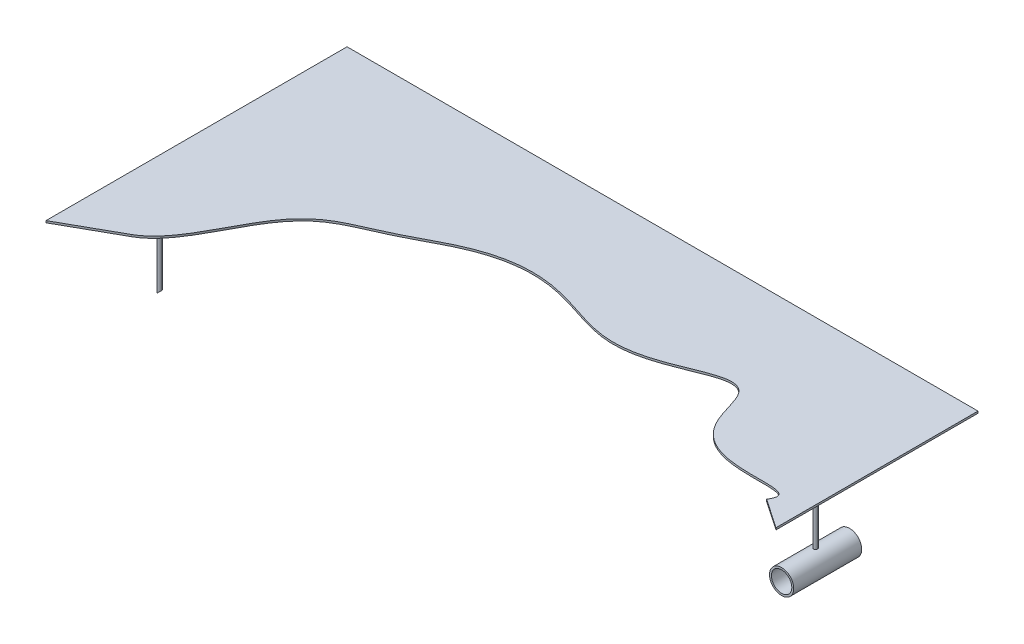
ISO-10303-21;
HEADER;
FILE_DESCRIPTION(('STEP AP214'),'2;1');
FILE_NAME('part.step','',(''),(''),'','','');
FILE_SCHEMA(('AUTOMOTIVE_DESIGN { 1 0 10303 214 1 1 1 1 }'));
ENDSEC;
DATA;
#1=APPLICATION_CONTEXT('core data for automotive mechanical design processes');
#2=APPLICATION_PROTOCOL_DEFINITION('international standard','automotive_design',2000,#1);
#3=PRODUCT_CONTEXT('',#1,'mechanical');
#4=PRODUCT('Part','Part','',(#3));
#5=PRODUCT_RELATED_PRODUCT_CATEGORY('part','',(#4));
#6=PRODUCT_DEFINITION_FORMATION('','',#4);
#7=PRODUCT_DEFINITION_CONTEXT('part definition',#1,'design');
#8=PRODUCT_DEFINITION('design','',#6,#7);
#9=PRODUCT_DEFINITION_SHAPE('','',#8);
#10=(LENGTH_UNIT() NAMED_UNIT(*) SI_UNIT(.MILLI.,.METRE.));
#11=(NAMED_UNIT(*) PLANE_ANGLE_UNIT() SI_UNIT($,.RADIAN.));
#12=(NAMED_UNIT(*) SI_UNIT($,.STERADIAN.) SOLID_ANGLE_UNIT());
#13=UNCERTAINTY_MEASURE_WITH_UNIT(LENGTH_MEASURE(1.E-05),#10,'distance_accuracy_value','');
#14=(GEOMETRIC_REPRESENTATION_CONTEXT(3) GLOBAL_UNCERTAINTY_ASSIGNED_CONTEXT((#13)) GLOBAL_UNIT_ASSIGNED_CONTEXT((#10,
#11,#12)) REPRESENTATION_CONTEXT('',''));
#15=CARTESIAN_POINT('',(0.,0.,0.));
#16=DIRECTION('',(0.,0.,1.));
#17=DIRECTION('',(1.,0.,0.));
#18=AXIS2_PLACEMENT_3D('',#15,#16,#17);
#19=CARTESIAN_POINT('',(529.614004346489,2.,-65.6099662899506));
#20=CARTESIAN_POINT('',(529.614004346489,0.,-65.6099662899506));
#21=CARTESIAN_POINT('',(553.118319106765,2.,-101.788543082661));
#22=CARTESIAN_POINT('',(553.118319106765,0.,-101.788543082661));
#23=CARTESIAN_POINT('',(392.87886326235,2.,-26.2044823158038));
#24=CARTESIAN_POINT('',(392.87886326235,0.,-26.2044823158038));
#25=CARTESIAN_POINT('',(472.231398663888,2.,-220.548587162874));
#26=CARTESIAN_POINT('',(472.231398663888,0.,-220.548587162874));
#27=CARTESIAN_POINT('',(318.84519234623,2.,-96.0981781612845));
#28=CARTESIAN_POINT('',(318.84519234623,0.,-96.0981781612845));
#29=CARTESIAN_POINT('',(245.664564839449,2.,-157.049080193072));
#30=CARTESIAN_POINT('',(245.664564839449,0.,-157.049080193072));
#31=CARTESIAN_POINT('',(153.077415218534,2.,-146.986132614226));
#32=CARTESIAN_POINT('',(153.077415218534,0.,-146.986132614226));
#33=CARTESIAN_POINT('',(87.8837580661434,2.,-92.7761560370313));
#34=CARTESIAN_POINT('',(87.8837580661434,0.,-92.7761560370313));
#35=CARTESIAN_POINT('',(19.1296861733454,2.,-92.4146928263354));
#36=CARTESIAN_POINT('',(19.1296861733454,0.,-92.4146928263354));
#37=CARTESIAN_POINT('',(3.09478121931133,2.,4.75428690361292));
#38=CARTESIAN_POINT('',(3.09478121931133,0.,4.75428690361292));
#39=CARTESIAN_POINT('',(-33.6131325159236,2.,25.3319359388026));
#40=CARTESIAN_POINT('',(-33.6131325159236,0.,25.3319359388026));
#41=B_SPLINE_SURFACE_WITH_KNOTS('',4,1,((#19,#20),(#21,#22),(#23,#24),(#25,#26),(#27,#28),(#29,
#30),(#31,#32),(#33,#34),(#35,#36),(#37,#38),(#39,#40)),.UNSPECIFIED.,.F.,.F.,.F.,(5,1,1,1,1,1,
1,5),(2,2),(-1.,-0.776087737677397,-0.660361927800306,-0.544234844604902,-0.42495608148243,
-0.309243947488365,-0.189495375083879,0.),(0.,0.2),.UNSPECIFIED.);
#42=CARTESIAN_POINT('',(529.614004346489,2.,-65.6099662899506));
#43=CARTESIAN_POINT('',(529.703482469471,2.,-65.7477005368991));
#44=CARTESIAN_POINT('',(529.792127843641,2.,-65.8859787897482));
#45=CARTESIAN_POINT('',(529.967652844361,2.,-66.1637997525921));
#46=CARTESIAN_POINT('',(530.054531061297,2.,-66.3033433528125));
#47=CARTESIAN_POINT('',(530.22632052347,2.,-66.5837204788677));
#48=CARTESIAN_POINT('',(530.311230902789,2.,-66.7245545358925));
#49=CARTESIAN_POINT('',(530.478859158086,2.,-67.0075507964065));
#50=CARTESIAN_POINT('',(530.561576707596,2.,-67.1497131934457));
#51=CARTESIAN_POINT('',(530.727290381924,2.,-67.4401804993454));
#52=CARTESIAN_POINT('',(530.81020422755,2.,-67.588532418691));
#53=CARTESIAN_POINT('',(530.973128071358,2.,-67.8867901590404));
#54=CARTESIAN_POINT('',(531.053138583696,2.,-68.0366956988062));
#55=CARTESIAN_POINT('',(531.2099151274,2.,-68.3381601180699));
#56=CARTESIAN_POINT('',(531.286681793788,2.,-68.489718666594));
#57=CARTESIAN_POINT('',(531.436577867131,2.,-68.7946118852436));
#58=CARTESIAN_POINT('',(531.50970753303,2.,-68.9479464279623));
#59=CARTESIAN_POINT('',(531.675985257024,2.,-69.3088692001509));
#60=CARTESIAN_POINT('',(531.767506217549,2.,-69.5172126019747));
#61=CARTESIAN_POINT('',(531.941807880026,2.,-69.9376022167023));
#62=CARTESIAN_POINT('',(532.024586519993,2.,-70.1496492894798));
#63=CARTESIAN_POINT('',(532.179665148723,2.,-70.577842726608));
#64=CARTESIAN_POINT('',(532.251953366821,2.,-70.7939933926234));
#65=CARTESIAN_POINT('',(532.382783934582,2.,-71.2274990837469));
#66=CARTESIAN_POINT('',(532.441487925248,2.,-71.4448046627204));
#67=CARTESIAN_POINT('',(532.54337533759,2.,-71.8828738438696));
#68=CARTESIAN_POINT('',(532.586572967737,2.,-72.1036340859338));
#69=CARTESIAN_POINT('',(532.653830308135,2.,-72.5477688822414));
#70=CARTESIAN_POINT('',(532.677927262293,2.,-72.7711374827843));
#71=CARTESIAN_POINT('',(532.697622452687,2.,-73.1265642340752));
#72=CARTESIAN_POINT('',(532.700882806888,2.,-73.2582084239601));
#73=CARTESIAN_POINT('',(532.698405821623,2.,-73.5214368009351));
#74=CARTESIAN_POINT('',(532.69266883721,2.,-73.653020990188));
#75=CARTESIAN_POINT('',(532.671266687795,2.,-73.9153299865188));
#76=CARTESIAN_POINT('',(532.655606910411,2.,-74.0460552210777));
#77=CARTESIAN_POINT('',(532.6135400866,2.,-74.3057589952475));
#78=CARTESIAN_POINT('',(532.587135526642,2.,-74.434737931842));
#79=CARTESIAN_POINT('',(532.522651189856,2.,-74.6911693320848));
#80=CARTESIAN_POINT('',(532.484454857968,2.,-74.8185927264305));
#81=CARTESIAN_POINT('',(532.396232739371,2.,-75.069286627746));
#82=CARTESIAN_POINT('',(532.346207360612,2.,-75.1925572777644));
#83=CARTESIAN_POINT('',(532.234528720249,2.,-75.4337363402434));
#84=CARTESIAN_POINT('',(532.172873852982,2.,-75.5516440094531));
#85=CARTESIAN_POINT('',(532.03860978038,2.,-75.7810380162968));
#86=CARTESIAN_POINT('',(531.966000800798,2.,-75.8925244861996));
#87=CARTESIAN_POINT('',(531.81929911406,2.,-76.0966282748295));
#88=CARTESIAN_POINT('',(531.746222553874,2.,-76.1899803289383));
#89=CARTESIAN_POINT('',(531.593065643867,2.,-76.3707542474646));
#90=CARTESIAN_POINT('',(531.512984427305,2.,-76.4581753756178));
#91=CARTESIAN_POINT('',(531.346752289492,2.,-76.6270157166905));
#92=CARTESIAN_POINT('',(531.260601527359,2.,-76.7084350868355));
#93=CARTESIAN_POINT('',(531.083117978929,2.,-76.8654034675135));
#94=CARTESIAN_POINT('',(530.991784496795,2.,-76.9409516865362));
#95=CARTESIAN_POINT('',(530.733501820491,2.,-77.1418413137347));
#96=CARTESIAN_POINT('',(530.561943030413,2.,-77.2612818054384));
#97=CARTESIAN_POINT('',(530.208967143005,2.,-77.484599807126));
#98=CARTESIAN_POINT('',(530.027542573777,2.,-77.5884652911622));
#99=CARTESIAN_POINT('',(529.656967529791,2.,-77.7830038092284));
#100=CARTESIAN_POINT('',(529.4677912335,2.,-77.8736272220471));
#101=CARTESIAN_POINT('',(529.084386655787,2.,-78.0431407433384));
#102=CARTESIAN_POINT('',(528.890160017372,2.,-78.1220346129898));
#103=CARTESIAN_POINT('',(528.396588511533,2.,-78.3080830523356));
#104=CARTESIAN_POINT('',(528.094810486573,2.,-78.4087618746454));
#105=CARTESIAN_POINT('',(527.485552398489,2.,-78.5921309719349));
#106=CARTESIAN_POINT('',(527.178065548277,2.,-78.6747981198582));
#107=CARTESIAN_POINT('',(526.559117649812,2.,-78.825754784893));
#108=CARTESIAN_POINT('',(526.247651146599,2.,-78.8940216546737));
#109=CARTESIAN_POINT('',(525.622326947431,2.,-79.0188101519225));
#110=CARTESIAN_POINT('',(525.308468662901,2.,-79.0753287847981));
#111=CARTESIAN_POINT('',(524.677689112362,2.,-79.1789797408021));
#112=CARTESIAN_POINT('',(524.360760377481,2.,-79.2260660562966));
#113=CARTESIAN_POINT('',(523.726211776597,2.,-79.3121463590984));
#114=CARTESIAN_POINT('',(523.40859322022,2.,-79.3511501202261));
#115=CARTESIAN_POINT('',(522.772782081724,2.,-79.4224467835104));
#116=CARTESIAN_POINT('',(522.454589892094,2.,-79.4547432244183));
#117=CARTESIAN_POINT('',(521.817719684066,2.,-79.5137106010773));
#118=CARTESIAN_POINT('',(521.499041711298,2.,-79.5403820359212));
#119=CARTESIAN_POINT('',(520.687813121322,2.,-79.6022072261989));
#120=CARTESIAN_POINT('',(520.195013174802,2.,-79.6340788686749));
#121=CARTESIAN_POINT('',(519.208794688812,2.,-79.689058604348));
#122=CARTESIAN_POINT('',(518.715376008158,2.,-79.7121640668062));
#123=CARTESIAN_POINT('',(517.728222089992,2.,-79.7515246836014));
#124=CARTESIAN_POINT('',(517.234486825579,2.,-79.7677791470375));
#125=CARTESIAN_POINT('',(516.248637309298,2.,-79.7949103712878));
#126=CARTESIAN_POINT('',(515.75652356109,2.,-79.8058061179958));
#127=CARTESIAN_POINT('',(514.7722818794,2.,-79.8235221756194));
#128=CARTESIAN_POINT('',(514.280153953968,2.,-79.8303429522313));
#129=CARTESIAN_POINT('',(513.295879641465,2.,-79.8409121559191));
#130=CARTESIAN_POINT('',(512.803733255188,2.,-79.844660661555));
#131=CARTESIAN_POINT('',(511.57318145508,2.,-79.851257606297));
#132=CARTESIAN_POINT('',(510.834769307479,2.,-79.8527172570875));
#133=CARTESIAN_POINT('',(509.357930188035,2.,-79.8530024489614));
#134=CARTESIAN_POINT('',(508.61950321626,2.,-79.8518279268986));
#135=CARTESIAN_POINT('',(507.142064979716,2.,-79.8487659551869));
#136=CARTESIAN_POINT('',(506.403053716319,2.,-79.846877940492));
#137=CARTESIAN_POINT('',(504.925026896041,2.,-79.8440294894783));
#138=CARTESIAN_POINT('',(504.186011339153,2.,-79.8430690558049));
#139=CARTESIAN_POINT('',(502.708241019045,2.,-79.8435102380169));
#140=CARTESIAN_POINT('',(501.969486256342,2.,-79.8449110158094));
#141=CARTESIAN_POINT('',(500.491993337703,2.,-79.8513588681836));
#142=CARTESIAN_POINT('',(499.753255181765,2.,-79.8564059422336));
#143=CARTESIAN_POINT('',(497.537055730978,2.,-79.8788160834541));
#144=CARTESIAN_POINT('',(496.059649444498,2.,-79.9034481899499));
#145=CARTESIAN_POINT('',(493.102325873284,2.,-79.9809884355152));
#146=CARTESIAN_POINT('',(491.622410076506,2.,-80.0339576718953));
#147=CARTESIAN_POINT('',(488.664370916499,2.,-80.1766771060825));
#148=CARTESIAN_POINT('',(487.186247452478,2.,-80.266425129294));
#149=CARTESIAN_POINT('',(484.233730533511,2.,-80.4912946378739));
#150=CARTESIAN_POINT('',(482.759336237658,2.,-80.6264047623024));
#151=CARTESIAN_POINT('',(479.81666633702,2.,-80.9510522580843));
#152=CARTESIAN_POINT('',(478.348389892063,2.,-81.140581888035));
#153=CARTESIAN_POINT('',(475.421449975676,2.,-81.5838198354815));
#154=CARTESIAN_POINT('',(473.962785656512,2.,-81.8375224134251));
#155=CARTESIAN_POINT('',(471.786299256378,2.,-82.2740035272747));
#156=CARTESIAN_POINT('',(471.062825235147,2.,-82.4287921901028));
#157=CARTESIAN_POINT('',(469.620458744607,2.,-82.7583940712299));
#158=CARTESIAN_POINT('',(468.901566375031,2.,-82.9332077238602));
#159=CARTESIAN_POINT('',(466.752064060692,2.,-83.49007868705));
#160=CARTESIAN_POINT('',(465.329504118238,2.,-83.9043943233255));
#161=CARTESIAN_POINT('',(463.218818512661,2.,-84.5988232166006));
#162=CARTESIAN_POINT('',(462.518603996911,2.,-84.8426671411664));
#163=CARTESIAN_POINT('',(461.127433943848,2.,-85.3560705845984));
#164=CARTESIAN_POINT('',(460.436480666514,2.,-85.625636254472));
#165=CARTESIAN_POINT('',(458.866217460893,2.,-86.2740351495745));
#166=CARTESIAN_POINT('',(457.990587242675,2.,-86.6618424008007));
#167=CARTESIAN_POINT('',(456.261506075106,2.,-87.484715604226));
#168=CARTESIAN_POINT('',(455.408060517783,2.,-87.9197929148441));
#169=CARTESIAN_POINT('',(453.727788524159,2.,-88.8388359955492));
#170=CARTESIAN_POINT('',(452.900963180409,2.,-89.3228037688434));
#171=CARTESIAN_POINT('',(451.279594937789,2.,-90.3397132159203));
#172=CARTESIAN_POINT('',(450.485007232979,2.,-90.8725833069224));
#173=CARTESIAN_POINT('',(448.931222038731,2.,-91.9876844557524));
#174=CARTESIAN_POINT('',(448.172024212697,2.,-92.5699150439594));
#175=CARTESIAN_POINT('',(446.693111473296,2.,-93.7823127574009));
#176=CARTESIAN_POINT('',(445.973389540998,2.,-94.4124713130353));
#177=CARTESIAN_POINT('',(444.619332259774,2.,-95.6783468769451));
#178=CARTESIAN_POINT('',(443.982467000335,2.,-96.3113612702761));
#179=CARTESIAN_POINT('',(442.748138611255,2.,-97.6147528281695));
#180=CARTESIAN_POINT('',(442.150677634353,2.,-98.2851320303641));
#181=CARTESIAN_POINT('',(440.996241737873,2.,-99.6597622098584));
#182=CARTESIAN_POINT('',(440.439264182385,2.,-100.364010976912));
#183=CARTESIAN_POINT('',(439.365025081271,2.,-101.803677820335));
#184=CARTESIAN_POINT('',(438.84782123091,2.,-102.539138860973));
#185=CARTESIAN_POINT('',(437.853110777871,2.,-104.036388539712));
#186=CARTESIAN_POINT('',(437.375605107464,2.,-104.798177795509));
#187=CARTESIAN_POINT('',(436.458600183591,2.,-106.344192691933));
#188=CARTESIAN_POINT('',(436.019099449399,2.,-107.128417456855));
#189=CARTESIAN_POINT('',(435.206314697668,2.,-108.658017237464));
#190=CARTESIAN_POINT('',(434.830539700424,2.,-109.402074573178));
#191=CARTESIAN_POINT('',(434.107235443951,2.,-110.903677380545));
#192=CARTESIAN_POINT('',(433.75970385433,2.,-111.66122173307));
#193=CARTESIAN_POINT('',(433.090158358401,2.,-113.187465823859));
#194=CARTESIAN_POINT('',(432.768144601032,2.,-113.956165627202));
#195=CARTESIAN_POINT('',(432.146629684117,2.,-115.502672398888));
#196=CARTESIAN_POINT('',(431.847130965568,2.,-116.280480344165));
#197=CARTESIAN_POINT('',(431.267476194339,2.,-117.843195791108));
#198=CARTESIAN_POINT('',(430.987319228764,2.,-118.628102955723));
#199=CARTESIAN_POINT('',(430.442886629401,2.,-120.203287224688));
#200=CARTESIAN_POINT('',(430.178609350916,2.,-120.993563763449));
#201=CARTESIAN_POINT('',(429.688151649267,2.,-122.498204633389));
#202=CARTESIAN_POINT('',(429.460815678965,2.,-123.21219455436));
#203=CARTESIAN_POINT('',(429.01290582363,2.,-124.642264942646));
#204=CARTESIAN_POINT('',(428.79233178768,2.,-125.358345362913));
#205=CARTESIAN_POINT('',(428.354552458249,2.,-126.79169794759));
#206=CARTESIAN_POINT('',(428.137347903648,2.,-127.508970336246));
#207=CARTESIAN_POINT('',(427.70247374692,2.,-128.943677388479));
#208=CARTESIAN_POINT('',(427.484803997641,2.,-129.661112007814));
#209=CARTESIAN_POINT('',(427.044922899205,2.,-131.093481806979));
#210=CARTESIAN_POINT('',(426.822718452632,2.,-131.808419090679));
#211=CARTESIAN_POINT('',(426.368517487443,2.,-133.235085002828));
#212=CARTESIAN_POINT('',(426.136522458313,2.,-133.946814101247));
#213=CARTESIAN_POINT('',(425.657275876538,2.,-135.364746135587));
#214=CARTESIAN_POINT('',(425.410032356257,2.,-136.070951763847));
#215=CARTESIAN_POINT('',(424.893868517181,2.,-137.475244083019));
#216=CARTESIAN_POINT('',(424.624955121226,2.,-138.17333328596));
#217=CARTESIAN_POINT('',(424.123669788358,2.,-139.397058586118));
#218=CARTESIAN_POINT('',(423.897290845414,2.,-139.925135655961));
#219=CARTESIAN_POINT('',(423.423338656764,2.,-140.971844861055));
#220=CARTESIAN_POINT('',(423.175762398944,2.,-141.490475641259));
#221=CARTESIAN_POINT('',(422.654949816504,2.,-142.515150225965));
#222=CARTESIAN_POINT('',(422.381701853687,2.,-143.021188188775));
#223=CARTESIAN_POINT('',(421.949216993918,2.,-143.767045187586));
#224=CARTESIAN_POINT('',(421.801298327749,2.,-144.013446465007));
#225=CARTESIAN_POINT('',(421.497268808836,2.,-144.501236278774));
#226=CARTESIAN_POINT('',(421.341155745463,2.,-144.742623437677));
#227=CARTESIAN_POINT('',(420.907133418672,2.,-145.387506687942));
#228=CARTESIAN_POINT('',(420.620871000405,2.,-145.785457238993));
#229=CARTESIAN_POINT('',(420.020435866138,2.,-146.559585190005));
#230=CARTESIAN_POINT('',(419.70627295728,2.,-146.935770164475));
#231=CARTESIAN_POINT('',(419.048698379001,2.,-147.660427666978));
#232=CARTESIAN_POINT('',(418.705353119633,2.,-148.008959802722));
#233=CARTESIAN_POINT('',(418.167727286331,2.,-148.507237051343));
#234=CARTESIAN_POINT('',(417.984727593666,2.,-148.669260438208));
#235=CARTESIAN_POINT('',(417.611274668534,2.,-148.984473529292));
#236=CARTESIAN_POINT('',(417.420821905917,2.,-149.13766378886));
#237=CARTESIAN_POINT('',(416.96487191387,2.,-149.486405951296));
#238=CARTESIAN_POINT('',(416.696388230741,2.,-149.67807583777));
#239=CARTESIAN_POINT('',(416.147026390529,2.,-150.042806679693));
#240=CARTESIAN_POINT('',(415.866146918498,2.,-150.215865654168));
#241=CARTESIAN_POINT('',(415.293250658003,2.,-150.542355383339));
#242=CARTESIAN_POINT('',(415.001235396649,2.,-150.695788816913));
#243=CARTESIAN_POINT('',(414.40716503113,2.,-150.982685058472));
#244=CARTESIAN_POINT('',(414.105099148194,2.,-151.116125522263));
#245=CARTESIAN_POINT('',(413.492802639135,2.,-151.362804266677));
#246=CARTESIAN_POINT('',(413.182570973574,2.,-151.476039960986));
#247=CARTESIAN_POINT('',(412.555589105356,2.,-151.682698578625));
#248=CARTESIAN_POINT('',(412.238838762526,2.,-151.776121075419));
#249=CARTESIAN_POINT('',(411.646322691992,2.,-151.93185052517));
#250=CARTESIAN_POINT('',(411.371219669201,2.,-151.996700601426));
#251=CARTESIAN_POINT('',(410.818202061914,2.,-152.113111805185));
#252=CARTESIAN_POINT('',(410.540287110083,2.,-152.164671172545));
#253=CARTESIAN_POINT('',(409.703475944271,2.,-152.300509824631));
#254=CARTESIAN_POINT('',(409.141458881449,2.,-152.36596362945));
#255=CARTESIAN_POINT('',(408.013025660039,2.,-152.453188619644));
#256=CARTESIAN_POINT('',(407.446602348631,2.,-152.474858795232));
#257=CARTESIAN_POINT('',(406.313666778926,2.,-152.480695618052));
#258=CARTESIAN_POINT('',(405.747154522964,2.,-152.46486312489));
#259=CARTESIAN_POINT('',(404.802129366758,2.,-152.411898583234));
#260=CARTESIAN_POINT('',(404.423080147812,2.,-152.383487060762));
#261=CARTESIAN_POINT('',(403.66613427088,2.,-152.31390885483));
#262=CARTESIAN_POINT('',(403.288237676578,2.,-152.272741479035));
#263=CARTESIAN_POINT('',(402.533814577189,2.,-152.179030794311));
#264=CARTESIAN_POINT('',(402.157288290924,2.,-152.126485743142));
#265=CARTESIAN_POINT('',(401.40578440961,2.,-152.011240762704));
#266=CARTESIAN_POINT('',(401.030806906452,2.,-151.948540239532));
#267=CARTESIAN_POINT('',(399.908765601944,2.,-151.746945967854));
#268=CARTESIAN_POINT('',(399.164123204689,2.,-151.59449835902));
#269=CARTESIAN_POINT('',(397.681549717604,2.,-151.260730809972));
#270=CARTESIAN_POINT('',(396.943617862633,2.,-151.079414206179));
#271=CARTESIAN_POINT('',(395.721180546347,2.,-150.758399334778));
#272=CARTESIAN_POINT('',(395.2349434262,2.,-150.62522362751));
#273=CARTESIAN_POINT('',(394.26499893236,2.,-150.349937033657));
#274=CARTESIAN_POINT('',(393.781291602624,2.,-150.207825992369));
#275=CARTESIAN_POINT('',(392.816109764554,2.,-149.915805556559));
#276=CARTESIAN_POINT('',(392.334635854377,2.,-149.765894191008));
#277=CARTESIAN_POINT('',(391.373842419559,2.,-149.459309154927));
#278=CARTESIAN_POINT('',(390.894522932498,2.,-149.30263536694));
#279=CARTESIAN_POINT('',(389.459385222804,2.,-148.823788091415));
#280=CARTESIAN_POINT('',(388.506498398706,2.,-148.49282262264));
#281=CARTESIAN_POINT('',(386.606576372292,2.,-147.81320171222));
#282=CARTESIAN_POINT('',(385.659544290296,2.,-147.464537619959));
#283=CARTESIAN_POINT('',(383.770515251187,2.,-146.754414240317));
#284=CARTESIAN_POINT('',(382.828517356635,2.,-146.392957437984));
#285=CARTESIAN_POINT('',(380.948045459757,2.,-145.661091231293));
#286=CARTESIAN_POINT('',(380.009571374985,2.,-145.290682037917));
#287=CARTESIAN_POINT('',(378.371755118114,2.,-144.638560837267));
#288=CARTESIAN_POINT('',(377.671917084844,2.,-144.3580902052));
#289=CARTESIAN_POINT('',(376.272999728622,2.,-143.795261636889));
#290=CARTESIAN_POINT('',(375.573920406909,2.,-143.512903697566));
#291=CARTESIAN_POINT('',(373.477729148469,2.,-142.664973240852));
#292=CARTESIAN_POINT('',(372.081062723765,2.,-142.098302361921));
#293=CARTESIAN_POINT('',(369.285678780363,2.,-140.969565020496));
#294=CARTESIAN_POINT('',(367.886961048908,2.,-140.407499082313));
#295=CARTESIAN_POINT('',(365.084812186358,2.,-139.294228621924));
#296=CARTESIAN_POINT('',(363.681380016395,2.,-138.743026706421));
#297=CARTESIAN_POINT('',(360.866940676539,2.,-137.656845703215));
#298=CARTESIAN_POINT('',(359.455928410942,2.,-137.121879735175));
#299=CARTESIAN_POINT('',(356.625777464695,2.,-136.073925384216));
#300=CARTESIAN_POINT('',(355.206638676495,2.,-135.560937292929));
#301=CARTESIAN_POINT('',(350.935699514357,2.,-134.062917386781));
#302=CARTESIAN_POINT('',(348.069287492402,2.,-133.118400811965));
#303=CARTESIAN_POINT('',(343.736409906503,2.,-131.81374714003));
#304=CARTESIAN_POINT('',(342.286746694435,2.,-131.397591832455));
#305=CARTESIAN_POINT('',(339.375299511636,2.,-130.607631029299));
#306=CARTESIAN_POINT('',(337.913511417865,2.,-130.233840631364));
#307=CARTESIAN_POINT('',(334.973747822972,2.,-129.532949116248));
#308=CARTESIAN_POINT('',(333.495735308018,2.,-129.206002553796));
#309=CARTESIAN_POINT('',(330.528906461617,2.,-128.605565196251));
#310=CARTESIAN_POINT('',(329.040090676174,2.,-128.332071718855));
#311=CARTESIAN_POINT('',(326.053223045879,2.,-127.843729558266));
#312=CARTESIAN_POINT('',(324.555173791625,2.,-127.628865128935));
#313=CARTESIAN_POINT('',(321.551482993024,2.,-127.26244439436));
#314=CARTESIAN_POINT('',(320.045842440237,2.,-127.110880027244));
#315=CARTESIAN_POINT('',(317.032411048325,2.,-126.875286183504));
#316=CARTESIAN_POINT('',(315.524631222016,2.,-126.791116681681));
#317=CARTESIAN_POINT('',(312.506870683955,2.,-126.692742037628));
#318=CARTESIAN_POINT('',(310.996890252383,2.,-126.678528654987));
#319=CARTESIAN_POINT('',(308.7327046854,2.,-126.710734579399));
#320=CARTESIAN_POINT('',(307.97803204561,2.,-126.730395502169));
#321=CARTESIAN_POINT('',(306.469368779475,2.,-126.787560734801));
#322=CARTESIAN_POINT('',(305.715378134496,2.,-126.825064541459));
#323=CARTESIAN_POINT('',(304.208444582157,2.,-126.917822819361));
#324=CARTESIAN_POINT('',(303.455501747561,2.,-126.97307846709));
#325=CARTESIAN_POINT('',(301.951126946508,2.,-127.101105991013));
#326=CARTESIAN_POINT('',(301.199694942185,2.,-127.173877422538));
#327=CARTESIAN_POINT('',(299.698826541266,2.,-127.336559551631));
#328=CARTESIAN_POINT('',(298.949389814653,2.,-127.426467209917));
#329=CARTESIAN_POINT('',(297.452706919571,2.,-127.622930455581));
#330=CARTESIAN_POINT('',(296.70546074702,2.,-127.729486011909));
#331=CARTESIAN_POINT('',(295.213491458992,2.,-127.958600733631));
#332=CARTESIAN_POINT('',(294.468768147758,2.,-128.081158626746));
#333=CARTESIAN_POINT('',(292.981989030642,2.,-128.341516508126));
#334=CARTESIAN_POINT('',(292.239933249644,2.,-128.479316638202));
#335=CARTESIAN_POINT('',(290.758032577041,2.,-128.769376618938));
#336=CARTESIAN_POINT('',(290.018189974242,2.,-128.921648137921));
#337=CARTESIAN_POINT('',(288.541365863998,2.,-129.23953237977));
#338=CARTESIAN_POINT('',(287.804384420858,2.,-129.405145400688));
#339=CARTESIAN_POINT('',(286.33321306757,2.,-129.748578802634));
#340=CARTESIAN_POINT('',(285.599023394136,2.,-129.926400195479));
#341=CARTESIAN_POINT('',(284.133372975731,2.,-130.292975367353));
#342=CARTESIAN_POINT('',(283.401912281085,2.,-130.481729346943));
#343=CARTESIAN_POINT('',(281.210692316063,2.,-131.062563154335));
#344=CARTESIAN_POINT('',(279.754751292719,2.,-131.469059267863));
#345=CARTESIAN_POINT('',(276.851185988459,2.,-132.310285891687));
#346=CARTESIAN_POINT('',(275.403561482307,2.,-132.745015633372));
#347=CARTESIAN_POINT('',(273.238208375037,2.,-133.410675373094));
#348=CARTESIAN_POINT('',(272.518293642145,2.,-133.634547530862));
#349=CARTESIAN_POINT('',(271.079594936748,2.,-134.085863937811));
#350=CARTESIAN_POINT('',(270.360810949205,2.,-134.313308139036));
#351=CARTESIAN_POINT('',(268.206023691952,2.,-134.999262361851));
#352=CARTESIAN_POINT('',(266.7712138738,2.,-135.461509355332));
#353=CARTESIAN_POINT('',(263.902064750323,2.,-136.387897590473));
#354=CARTESIAN_POINT('',(262.467725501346,2.,-136.852039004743));
#355=CARTESIAN_POINT('',(259.597225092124,2.,-137.774642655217));
#356=CARTESIAN_POINT('',(258.161063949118,2.,-138.233104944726));
#357=CARTESIAN_POINT('',(255.284548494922,2.,-139.137392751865));
#358=CARTESIAN_POINT('',(253.844193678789,2.,-139.583216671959));
#359=CARTESIAN_POINT('',(250.957734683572,2.,-140.455591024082));
#360=CARTESIAN_POINT('',(249.511630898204,2.,-140.882142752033));
#361=CARTESIAN_POINT('',(246.612003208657,2.,-141.709954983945));
#362=CARTESIAN_POINT('',(245.158478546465,2.,-142.111212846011));
#363=CARTESIAN_POINT('',(242.242919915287,2.,-142.882824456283));
#364=CARTESIAN_POINT('',(240.780884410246,2.,-143.25317242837));
#365=CARTESIAN_POINT('',(237.845284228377,2.,-143.958401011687));
#366=CARTESIAN_POINT('',(236.371702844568,2.,-144.293212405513));
#367=CARTESIAN_POINT('',(233.415742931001,2.,-144.921918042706));
#368=CARTESIAN_POINT('',(231.933364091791,2.,-145.215810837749));
#369=CARTESIAN_POINT('',(228.960636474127,2.,-145.758559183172));
#370=CARTESIAN_POINT('',(227.470289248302,2.,-146.00742320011));
#371=CARTESIAN_POINT('',(224.482394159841,2.,-146.456768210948));
#372=CARTESIAN_POINT('',(222.984846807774,2.,-146.657252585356));
#373=CARTESIAN_POINT('',(219.985653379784,2.,-147.006953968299));
#374=CARTESIAN_POINT('',(218.484014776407,2.,-147.156234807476));
#375=CARTESIAN_POINT('',(215.476491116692,2.,-147.401936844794));
#376=CARTESIAN_POINT('',(213.970606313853,2.,-147.498361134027));
#377=CARTESIAN_POINT('',(210.956227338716,2.,-147.637199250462));
#378=CARTESIAN_POINT('',(209.447732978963,2.,-147.679609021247));
#379=CARTESIAN_POINT('',(206.430175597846,2.,-147.709992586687));
#380=CARTESIAN_POINT('',(204.921112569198,2.,-147.697965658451));
#381=CARTESIAN_POINT('',(201.904507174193,2.,-147.619777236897));
#382=CARTESIAN_POINT('',(200.396964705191,2.,-147.553619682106));
#383=CARTESIAN_POINT('',(197.385037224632,2.,-147.368168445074));
#384=CARTESIAN_POINT('',(195.880652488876,2.,-147.248870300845));
#385=CARTESIAN_POINT('',(192.877075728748,2.,-146.958385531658));
#386=CARTESIAN_POINT('',(191.377883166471,2.,-146.787204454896));
#387=CARTESIAN_POINT('',(188.386150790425,2.,-146.394177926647));
#388=CARTESIAN_POINT('',(186.893611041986,2.,-146.172331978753));
#389=CARTESIAN_POINT('',(183.916805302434,2.,-145.679303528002));
#390=CARTESIAN_POINT('',(182.432538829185,2.,-145.408123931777));
#391=CARTESIAN_POINT('',(179.473600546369,2.,-144.817839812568));
#392=CARTESIAN_POINT('',(177.998928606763,2.,-144.498735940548));
#393=CARTESIAN_POINT('',(175.060532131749,2.,-143.814189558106));
#394=CARTESIAN_POINT('',(173.59680663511,2.,-143.448751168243));
#395=CARTESIAN_POINT('',(170.681164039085,2.,-142.673226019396));
#396=CARTESIAN_POINT('',(169.229247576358,2.,-142.263136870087));
#397=CARTESIAN_POINT('',(166.336360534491,2.,-141.399726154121));
#398=CARTESIAN_POINT('',(164.895405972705,2.,-140.946350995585));
#399=CARTESIAN_POINT('',(162.026858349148,2.,-139.998967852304));
#400=CARTESIAN_POINT('',(160.599265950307,2.,-139.504957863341));
#401=CARTESIAN_POINT('',(157.757660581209,2.,-138.478703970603));
#402=CARTESIAN_POINT('',(156.343649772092,2.,-137.94645409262));
#403=CARTESIAN_POINT('',(153.529509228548,2.,-136.846557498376));
#404=CARTESIAN_POINT('',(152.129379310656,2.,-136.278911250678));
#405=CARTESIAN_POINT('',(149.34415223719,2.,-135.111921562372));
#406=CARTESIAN_POINT('',(147.959040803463,2.,-134.512612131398));
#407=CARTESIAN_POINT('',(145.201662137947,2.,-133.285186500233));
#408=CARTESIAN_POINT('',(143.829394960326,2.,-132.65707017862));
#409=CARTESIAN_POINT('',(141.096655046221,2.,-131.375891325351));
#410=CARTESIAN_POINT('',(139.736181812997,2.,-130.722829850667));
#411=CARTESIAN_POINT('',(137.025403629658,2.,-129.395991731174));
#412=CARTESIAN_POINT('',(135.675098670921,2.,-128.722215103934));
#413=CARTESIAN_POINT('',(132.983805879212,2.,-127.359283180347));
#414=CARTESIAN_POINT('',(131.642810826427,2.,-126.670142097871));
#415=CARTESIAN_POINT('',(128.966414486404,2.,-125.281106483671));
#416=CARTESIAN_POINT('',(127.631013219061,2.,-124.58121191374));
#417=CARTESIAN_POINT('',(124.962771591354,2.,-123.176529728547));
#418=CARTESIAN_POINT('',(123.629931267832,2.,-122.471742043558));
#419=CARTESIAN_POINT('',(120.96379384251,2.,-121.063036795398));
#420=CARTESIAN_POINT('',(119.630496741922,2.,-120.359119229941));
#421=CARTESIAN_POINT('',(116.960791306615,2.,-118.956886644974));
#422=CARTESIAN_POINT('',(115.624382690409,2.,-118.258572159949));
#423=CARTESIAN_POINT('',(112.946604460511,2.,-116.871506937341));
#424=CARTESIAN_POINT('',(111.605234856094,2.,-116.182756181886));
#425=CARTESIAN_POINT('',(108.91626613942,2.,-114.817720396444));
#426=CARTESIAN_POINT('',(107.568667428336,2.,-114.141434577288));
#427=CARTESIAN_POINT('',(104.866455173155,2.,-112.803019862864));
#428=CARTESIAN_POINT('',(103.511841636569,2.,-112.140890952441));
#429=CARTESIAN_POINT('',(100.795434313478,2.,-110.831249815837));
#430=CARTESIAN_POINT('',(99.4336399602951,2.,-110.183738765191));
#431=CARTESIAN_POINT('',(96.703541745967,2.,-108.902598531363));
#432=CARTESIAN_POINT('',(95.3352378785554,2.,-108.268969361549));
#433=CARTESIAN_POINT('',(92.5932609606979,2.,-107.013447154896));
#434=CARTESIAN_POINT('',(91.2195878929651,2.,-106.391554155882));
#435=CARTESIAN_POINT('',(88.4685565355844,2.,-105.155985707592));
#436=CARTESIAN_POINT('',(87.0911982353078,2.,-104.542310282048));
#437=CARTESIAN_POINT('',(84.3354595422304,2.,-103.318505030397));
#438=CARTESIAN_POINT('',(82.9570796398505,2.,-102.708374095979));
#439=CARTESIAN_POINT('',(80.2015683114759,2.,-101.485276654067));
#440=CARTESIAN_POINT('',(78.8244368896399,2.,-100.872310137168));
#441=CARTESIAN_POINT('',(76.0742203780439,2.,-99.6359241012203));
#442=CARTESIAN_POINT('',(74.7011370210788,2.,-99.01250070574));
#443=CARTESIAN_POINT('',(71.9635596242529,2.,-97.7469653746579));
#444=CARTESIAN_POINT('',(70.5990656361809,2.,-97.1048533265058));
#445=CARTESIAN_POINT('',(67.8796111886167,2.,-95.7907251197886));
#446=CARTESIAN_POINT('',(66.5246892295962,2.,-95.1186285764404));
#447=CARTESIAN_POINT('',(64.5069650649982,2.,-94.0819070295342));
#448=CARTESIAN_POINT('',(63.8368217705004,2.,-93.7315639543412));
#449=CARTESIAN_POINT('',(62.50227730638,2.,-93.020087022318));
#450=CARTESIAN_POINT('',(61.837876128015,2.,-92.6589531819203));
#451=CARTESIAN_POINT('',(60.5162370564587,2.,-91.9249136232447));
#452=CARTESIAN_POINT('',(59.8589942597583,2.,-91.5520167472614));
#453=CARTESIAN_POINT('',(58.5521501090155,2.,-90.7930461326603));
#454=CARTESIAN_POINT('',(57.902548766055,2.,-90.4069723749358));
#455=CARTESIAN_POINT('',(56.6119578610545,2.,-89.6207564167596));
#456=CARTESIAN_POINT('',(55.9709677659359,2.,-89.2206150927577));
#457=CARTESIAN_POINT('',(54.6984560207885,2.,-88.4055758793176));
#458=CARTESIAN_POINT('',(54.0669342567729,2.,-87.9906781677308));
#459=CARTESIAN_POINT('',(52.4107021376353,2.,-86.8734804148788));
#460=CARTESIAN_POINT('',(51.3947096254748,2.,-86.1581759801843));
#461=CARTESIAN_POINT('',(49.3936436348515,2.,-84.6855708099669));
#462=CARTESIAN_POINT('',(48.4085699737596,2.,-83.9282703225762));
#463=CARTESIAN_POINT('',(46.4713913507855,2.,-82.3721339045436));
#464=CARTESIAN_POINT('',(45.5192943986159,2.,-81.5732879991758));
#465=CARTESIAN_POINT('',(43.6497613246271,2.,-79.9360349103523));
#466=CARTESIAN_POINT('',(42.7323253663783,2.,-79.0976275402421));
#467=CARTESIAN_POINT('',(40.9335812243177,2.,-77.3847862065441));
#468=CARTESIAN_POINT('',(40.0522364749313,2.,-76.5103906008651));
#469=CARTESIAN_POINT('',(38.324346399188,2.,-74.7279110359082));
#470=CARTESIAN_POINT('',(37.4778012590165,2.,-73.8198268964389));
#471=CARTESIAN_POINT('',(35.8184038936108,2.,-71.9733038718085));
#472=CARTESIAN_POINT('',(35.0055540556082,2.,-71.0348628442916));
#473=CARTESIAN_POINT('',(33.4120068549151,2.,-69.1311633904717));
#474=CARTESIAN_POINT('',(32.631309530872,2.,-68.1659049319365));
#475=CARTESIAN_POINT('',(30.3372791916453,2.,-65.2386100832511));
#476=CARTESIAN_POINT('',(28.8686987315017,2.,-63.2413273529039));
#477=CARTESIAN_POINT('',(26.741516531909,2.,-60.1935712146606));
#478=CARTESIAN_POINT('',(26.0450633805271,2.,-59.1690023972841));
#479=CARTESIAN_POINT('',(24.6745958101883,2.,-57.1049368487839));
#480=CARTESIAN_POINT('',(24.0005810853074,2.,-56.0654403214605));
#481=CARTESIAN_POINT('',(22.6733987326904,2.,-53.975493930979));
#482=CARTESIAN_POINT('',(22.0202008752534,2.,-52.9250631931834));
#483=CARTESIAN_POINT('',(20.7310152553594,2.,-50.8138671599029));
#484=CARTESIAN_POINT('',(20.0950256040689,2.,-49.7531030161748));
#485=CARTESIAN_POINT('',(18.8375412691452,2.,-47.6228997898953));
#486=CARTESIAN_POINT('',(18.2160479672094,2.,-46.5534598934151));
#487=CARTESIAN_POINT('',(16.9850786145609,2.,-44.4076799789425));
#488=CARTESIAN_POINT('',(16.3756027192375,2.,-43.3313398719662));
#489=CARTESIAN_POINT('',(14.5613779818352,2.,-40.0941699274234));
#490=CARTESIAN_POINT('',(13.3709225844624,2.,-37.9253454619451));
#491=CARTESIAN_POINT('',(11.0091423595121,2.,-33.578254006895));
#492=CARTESIAN_POINT('',(9.83781188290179,2.,-31.3999900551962));
#493=CARTESIAN_POINT('',(7.49485851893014,2.,-27.0434285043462));
#494=CARTESIAN_POINT('',(6.32323561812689,2.,-24.865130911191));
#495=CARTESIAN_POINT('',(4.55124814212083,2.,-21.6056635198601));
#496=CARTESIAN_POINT('',(3.95817929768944,2.,-20.5205387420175));
#497=CARTESIAN_POINT('',(2.76469546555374,2.,-18.3543393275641));
#498=CARTESIAN_POINT('',(2.16428052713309,2.,-17.2732646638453));
#499=CARTESIAN_POINT('',(0.953550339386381,2.,-15.1166657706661));
#500=CARTESIAN_POINT('',(0.343235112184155,2.,-14.0411415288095));
#501=CARTESIAN_POINT('',(-0.890054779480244,2.,-11.8971199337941));
#502=CARTESIAN_POINT('',(-1.51303156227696,2.,-10.8286237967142));
#503=CARTESIAN_POINT('',(-2.77491681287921,2.,-8.69969276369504));
#504=CARTESIAN_POINT('',(-3.41383982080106,2.,-7.63926646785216));
#505=CARTESIAN_POINT('',(-4.70998463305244,2.,-5.52960013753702));
#506=CARTESIAN_POINT('',(-5.36720682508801,2.,-4.48036034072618));
#507=CARTESIAN_POINT('',(-6.70279883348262,2.,-2.39586970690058));
#508=CARTESIAN_POINT('',(-7.38116179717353,2.,-1.36061448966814));
#509=CARTESIAN_POINT('',(-8.76243389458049,2.,0.693353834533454));
#510=CARTESIAN_POINT('',(-9.46534172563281,2.,1.71206781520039));
#511=CARTESIAN_POINT('',(-10.8988396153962,2.,3.72927666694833));
#512=CARTESIAN_POINT('',(-11.6294186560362,2.,4.72777934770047));
#513=CARTESIAN_POINT('',(-13.1223825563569,2.,6.70153204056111));
#514=CARTESIAN_POINT('',(-13.8847819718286,2.,7.67677108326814));
#515=CARTESIAN_POINT('',(-15.3211009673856,2.,9.44664880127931));
#516=CARTESIAN_POINT('',(-15.9899114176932,2.,10.24542921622));
#517=CARTESIAN_POINT('',(-17.3544933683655,2.,11.8197084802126));
#518=CARTESIAN_POINT('',(-18.0502653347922,2.,12.5952069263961));
#519=CARTESIAN_POINT('',(-19.4701445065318,2.,14.1185921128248));
#520=CARTESIAN_POINT('',(-20.1942259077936,2.,14.8665028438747));
#521=CARTESIAN_POINT('',(-21.6731755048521,2.,16.3313939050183));
#522=CARTESIAN_POINT('',(-22.4280450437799,2.,17.0483728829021));
#523=CARTESIAN_POINT('',(-23.9943079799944,2.,18.4688263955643));
#524=CARTESIAN_POINT('',(-24.8067324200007,2.,19.1711669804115));
#525=CARTESIAN_POINT('',(-26.46700485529,2.,20.5326030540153));
#526=CARTESIAN_POINT('',(-27.314846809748,2.,21.1917058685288));
#527=CARTESIAN_POINT('',(-28.6152117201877,2.,22.144942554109));
#528=CARTESIAN_POINT('',(-29.0543837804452,2.,22.4574022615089));
#529=CARTESIAN_POINT('',(-29.941734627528,2.,23.0692723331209));
#530=CARTESIAN_POINT('',(-30.3899132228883,2.,23.3686829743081));
#531=CARTESIAN_POINT('',(-31.2954857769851,2.,23.9539175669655));
#532=CARTESIAN_POINT('',(-31.752885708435,2.,24.2397322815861));
#533=CARTESIAN_POINT('',(-32.676472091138,2.,24.7968796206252));
#534=CARTESIAN_POINT('',(-33.1426592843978,2.,25.0682110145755));
#535=CARTESIAN_POINT('',(-33.6131325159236,2.,25.3319359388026));
#536=B_SPLINE_CURVE_WITH_KNOTS('',3,(#42,#43,#44,#45,#46,#47,#48,#49,#50,#51,#52,#53,#54,#55,
#56,#57,#58,#59,#60,#61,#62,#63,#64,#65,#66,#67,#68,#69,#70,#71,#72,#73,#74,#75,#76,#77,#78,#79,
#80,#81,#82,#83,#84,#85,#86,#87,#88,#89,#90,#91,#92,#93,#94,#95,#96,#97,#98,#99,#100,#101,#102,
#103,#104,#105,#106,#107,#108,#109,#110,#111,#112,#113,#114,#115,#116,#117,#118,#119,#120,#121,
#122,#123,#124,#125,#126,#127,#128,#129,#130,#131,#132,#133,#134,#135,#136,#137,#138,#139,#140,
#141,#142,#143,#144,#145,#146,#147,#148,#149,#150,#151,#152,#153,#154,#155,#156,#157,#158,#159,
#160,#161,#162,#163,#164,#165,#166,#167,#168,#169,#170,#171,#172,#173,#174,#175,#176,#177,#178,
#179,#180,#181,#182,#183,#184,#185,#186,#187,#188,#189,#190,#191,#192,#193,#194,#195,#196,#197,
#198,#199,#200,#201,#202,#203,#204,#205,#206,#207,#208,#209,#210,#211,#212,#213,#214,#215,#216,
#217,#218,#219,#220,#221,#222,#223,#224,#225,#226,#227,#228,#229,#230,#231,#232,#233,#234,#235,
#236,#237,#238,#239,#240,#241,#242,#243,#244,#245,#246,#247,#248,#249,#250,#251,#252,#253,#254,
#255,#256,#257,#258,#259,#260,#261,#262,#263,#264,#265,#266,#267,#268,#269,#270,#271,#272,#273,
#274,#275,#276,#277,#278,#279,#280,#281,#282,#283,#284,#285,#286,#287,#288,#289,#290,#291,#292,
#293,#294,#295,#296,#297,#298,#299,#300,#301,#302,#303,#304,#305,#306,#307,#308,#309,#310,#311,
#312,#313,#314,#315,#316,#317,#318,#319,#320,#321,#322,#323,#324,#325,#326,#327,#328,#329,#330,
#331,#332,#333,#334,#335,#336,#337,#338,#339,#340,#341,#342,#343,#344,#345,#346,#347,#348,#349,
#350,#351,#352,#353,#354,#355,#356,#357,#358,#359,#360,#361,#362,#363,#364,#365,#366,#367,#368,
#369,#370,#371,#372,#373,#374,#375,#376,#377,#378,#379,#380,#381,#382,#383,#384,#385,#386,#387,
#388,#389,#390,#391,#392,#393,#394,#395,#396,#397,#398,#399,#400,#401,#402,#403,#404,#405,#406,
#407,#408,#409,#410,#411,#412,#413,#414,#415,#416,#417,#418,#419,#420,#421,#422,#423,#424,#425,
#426,#427,#428,#429,#430,#431,#432,#433,#434,#435,#436,#437,#438,#439,#440,#441,#442,#443,#444,
#445,#446,#447,#448,#449,#450,#451,#452,#453,#454,#455,#456,#457,#458,#459,#460,#461,#462,#463,
#464,#465,#466,#467,#468,#469,#470,#471,#472,#473,#474,#475,#476,#477,#478,#479,#480,#481,#482,
#483,#484,#485,#486,#487,#488,#489,#490,#491,#492,#493,#494,#495,#496,#497,#498,#499,#500,#501,
#502,#503,#504,#505,#506,#507,#508,#509,#510,#511,#512,#513,#514,#515,#516,#517,#518,#519,#520,
#521,#522,#523,#524,#525,#526,#527,#528,#529,#530,#531,#532,#533,#534,#535),.UNSPECIFIED.,.F.,
.F.,(4,2,2,2,2,2,2,2,2,2,2,2,2,2,2,2,2,2,2,2,2,2,2,2,2,2,2,2,2,2,2,2,2,2,2,2,2,2,2,2,2,2,2,2,2,
2,2,2,2,2,2,2,2,2,2,2,2,2,2,2,2,2,2,2,2,2,2,2,2,2,2,2,2,2,2,2,2,2,2,2,2,2,2,2,2,2,2,2,2,2,2,2,2,
2,2,2,2,2,2,2,2,2,2,2,2,2,2,2,2,2,2,2,2,2,2,2,2,2,2,2,2,2,2,2,2,2,2,2,2,2,2,2,2,2,2,2,2,2,2,2,2,
2,2,2,2,2,2,2,2,2,2,2,2,2,2,2,2,2,2,2,2,2,2,2,2,2,2,2,2,2,2,2,2,2,2,2,2,2,2,2,2,2,2,2,2,2,2,2,2,
2,2,2,2,2,2,2,2,2,2,2,2,2,2,2,2,2,2,2,2,2,2,2,2,2,2,2,2,2,2,2,2,2,2,2,2,2,2,2,2,2,2,2,2,2,2,2,2,
2,2,2,2,2,2,2,2,2,4),(0.,0.492741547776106,0.985861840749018,1.47919515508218,1.97260150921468,
2.48242235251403,2.99215246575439,3.50178232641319,4.01137585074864,4.69388000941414,
5.37654478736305,6.05996971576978,6.73478810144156,7.40898656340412,8.08186716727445,
8.47666467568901,8.87144660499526,9.26601436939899,9.66049087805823,10.0589986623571,
10.4574927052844,10.8560418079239,11.2545826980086,11.6098728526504,11.9652070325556,
12.3205319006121,12.6759045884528,13.3019445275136,13.9284653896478,14.5572768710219,
15.1858862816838,16.1394757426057,17.0942824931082,18.050579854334,19.0071206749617,
19.9682192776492,20.9281488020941,21.8875705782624,22.8469071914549,24.3282844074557,
25.810105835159,27.2920766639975,28.7687583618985,30.2452712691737,31.7217464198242,
33.9369762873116,36.1522592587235,38.3693002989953,40.5863476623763,42.8026082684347,
45.0188685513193,49.4515090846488,53.8937455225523,58.335719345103,62.7765815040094,
67.2168122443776,71.6566459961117,73.8759253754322,76.0952528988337,80.5365799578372,
82.7605512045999,84.9850556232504,87.8566918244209,90.7290195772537,93.6014650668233,
96.4697709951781,99.3380496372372,102.205816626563,104.897999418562,107.590329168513,
110.282483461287,112.978472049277,115.674523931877,118.370470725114,120.870522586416,
123.370367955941,125.870227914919,128.370358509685,130.870371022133,133.3701241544,
135.618002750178,137.865831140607,140.114145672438,142.363328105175,144.609310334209,
146.854952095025,149.099420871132,151.343175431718,153.06646495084,154.789999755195,
156.514319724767,157.376352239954,158.238618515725,159.708089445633,161.177045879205,
162.642744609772,163.375768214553,164.108745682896,165.097617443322,166.086594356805,
167.075436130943,168.065374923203,169.055440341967,170.045527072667,170.893113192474,
171.740811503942,173.436039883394,175.135174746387,176.834270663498,177.974404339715,
179.1145999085,180.254970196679,181.39540719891,183.674861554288,185.95405266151,
187.466402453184,188.978778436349,190.491538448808,192.004324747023,195.030244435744,
198.057657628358,201.084485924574,204.111242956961,206.373082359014,208.634925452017,
213.156667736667,217.678917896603,222.20224022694,226.729125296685,231.256070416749,
240.306451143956,244.830576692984,249.356309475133,253.896646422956,258.436755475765,
262.975643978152,267.513954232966,272.042810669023,276.571133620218,278.835745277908,
281.100293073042,283.364990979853,285.629631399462,287.89387053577,290.158105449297,
292.422160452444,294.686236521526,296.952153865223,299.218121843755,301.484277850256,
303.750475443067,308.284892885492,312.819186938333,315.080941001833,317.342664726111,
321.864945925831,326.387648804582,330.910309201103,335.433538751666,339.956463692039,
344.479860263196,349.004100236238,353.536996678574,358.070053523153,362.602257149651,
367.134143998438,371.660360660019,376.186312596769,380.712604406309,385.238956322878,
389.764978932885,394.291381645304,398.817300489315,403.343263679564,407.868960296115,
412.394595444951,416.91982840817,421.445303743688,425.976456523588,430.507832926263,
435.039918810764,439.571944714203,444.099197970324,448.626470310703,453.153551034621,
457.680627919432,462.203677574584,466.726743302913,471.249873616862,475.772992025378,
480.296536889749,484.820073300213,489.343322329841,493.866566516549,498.390173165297,
502.913784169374,507.437409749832,511.961048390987,516.483186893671,521.005340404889,
525.529209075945,530.053104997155,534.589958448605,536.858465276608,539.126968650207,
541.393805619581,543.660645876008,545.927345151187,548.194017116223,551.920514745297,
555.646990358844,559.374364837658,563.101756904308,566.825274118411,570.548811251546,
574.272611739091,577.996416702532,585.4291018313,589.145525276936,592.861898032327,
596.572602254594,600.28289751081,603.993544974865,607.704240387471,615.126169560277,
622.545865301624,629.96601182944,633.675848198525,637.385659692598,641.095462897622,
644.805891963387,648.519837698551,652.233862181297,655.946695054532,659.659331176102,
663.370504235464,667.083393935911,670.208275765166,673.333211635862,676.455362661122,
679.577650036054,682.798137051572,686.018077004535,687.634834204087,689.251557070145,
690.869363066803,692.487306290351),.UNSPECIFIED.);
#537=CARTESIAN_POINT('',(529.614004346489,2.,-65.6099662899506));
#538=VERTEX_POINT('',#537);
#539=CARTESIAN_POINT('',(-33.6131325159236,2.,25.3319359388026));
#540=VERTEX_POINT('',#539);
#541=EDGE_CURVE('P0_E26',#538,#540,#536,.T.);
#542=DIRECTION('',(0.,-1.,0.));
#543=VECTOR('',#542,1.);
#544=CARTESIAN_POINT('',(-33.6131325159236,0.999999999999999,25.3319359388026));
#545=LINE('',#544,#543);
#546=CARTESIAN_POINT('',(-33.6131325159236,0.,25.3319359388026));
#547=VERTEX_POINT('',#546);
#548=EDGE_CURVE('P0_E11',#540,#547,#545,.T.);
#549=CARTESIAN_POINT('',(-33.6131325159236,0.,25.3319359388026));
#550=CARTESIAN_POINT('',(-33.030896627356,0.,25.0055650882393));
#551=CARTESIAN_POINT('',(-32.4552811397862,0.,24.6675744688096));
#552=CARTESIAN_POINT('',(-31.3176345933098,0.,23.9697084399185));
#553=CARTESIAN_POINT('',(-30.7556006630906,0.,23.6098377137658));
#554=CARTESIAN_POINT('',(-29.0799174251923,0.,22.4924848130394));
#555=CARTESIAN_POINT('',(-27.9872873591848,0.,21.7032415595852));
#556=CARTESIAN_POINT('',(-25.8580880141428,0.,20.0519518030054));
#557=CARTESIAN_POINT('',(-24.8215474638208,0.,19.1898685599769));
#558=CARTESIAN_POINT('',(-22.8015176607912,0.,17.4026816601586));
#559=CARTESIAN_POINT('',(-21.8181169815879,0.,16.4774782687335));
#560=CARTESIAN_POINT('',(-19.9031709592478,0.,14.5754938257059));
#561=CARTESIAN_POINT('',(-18.9716153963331,0.,13.5987230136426));
#562=CARTESIAN_POINT('',(-17.1652370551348,0.,11.6122531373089));
#563=CARTESIAN_POINT('',(-16.2899351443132,0.,10.6029879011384));
#564=CARTESIAN_POINT('',(-14.582385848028,0.,8.55052500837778));
#565=CARTESIAN_POINT('',(-13.7500959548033,0.,7.50736257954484));
#566=CARTESIAN_POINT('',(-12.1232476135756,0.,5.39234866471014));
#567=CARTESIAN_POINT('',(-11.3286840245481,0.,4.32050111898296));
#568=CARTESIAN_POINT('',(-9.77252061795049,0.,2.15275638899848));
#569=CARTESIAN_POINT('',(-9.01093017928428,0.,1.05685249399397));
#570=CARTESIAN_POINT('',(-7.51649518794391,0.,-1.15472232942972));
#571=CARTESIAN_POINT('',(-6.78365785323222,0.,-2.2703981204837));
#572=CARTESIAN_POINT('',(-5.3428256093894,0.,-4.51771352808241));
#573=CARTESIAN_POINT('',(-4.63483197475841,0.,-5.64935395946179));
#574=CARTESIAN_POINT('',(-3.23981844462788,0.,-7.92558412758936));
#575=CARTESIAN_POINT('',(-2.55280028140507,0.,-9.07017492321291));
#576=CARTESIAN_POINT('',(-1.19616683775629,0.,-11.3695706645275));
#577=CARTESIAN_POINT('',(-0.526551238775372,0.,-12.524375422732));
#578=CARTESIAN_POINT('',(0.79806341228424,0.,-14.8407345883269));
#579=CARTESIAN_POINT('',(1.4530768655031,0.,-16.0022807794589));
#580=CARTESIAN_POINT('',(2.7524302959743,0.,-18.3311677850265));
#581=CARTESIAN_POINT('',(3.39677129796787,0.,-19.498508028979));
#582=CARTESIAN_POINT('',(4.67799882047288,0.,-21.8372352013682));
#583=CARTESIAN_POINT('',(5.31488547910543,0.,-23.008622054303));
#584=CARTESIAN_POINT('',(6.58431171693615,0.,-25.3537992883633));
#585=CARTESIAN_POINT('',(7.21685113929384,0.,-26.5275897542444));
#586=CARTESIAN_POINT('',(9.11243921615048,0.,-30.0500551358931));
#587=CARTESIAN_POINT('',(10.3734539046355,0.,-32.399817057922));
#588=CARTESIAN_POINT('',(12.9138428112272,0.,-37.0894141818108));
#589=CARTESIAN_POINT('',(14.1932164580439,0.,-39.4292496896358));
#590=CARTESIAN_POINT('',(16.1442289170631,0.,-42.9213273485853));
#591=CARTESIAN_POINT('',(16.7999197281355,0.,-44.082455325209));
#592=CARTESIAN_POINT('',(18.1250489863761,0.,-46.3968318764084));
#593=CARTESIAN_POINT('',(18.7944872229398,0.,-47.5500805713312));
#594=CARTESIAN_POINT('',(20.1503258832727,0.,-49.8466665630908));
#595=CARTESIAN_POINT('',(20.8367271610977,0.,-50.9900033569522));
#596=CARTESIAN_POINT('',(22.2297779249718,0.,-53.2644799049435));
#597=CARTESIAN_POINT('',(22.9364297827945,0.,-54.3956182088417));
#598=CARTESIAN_POINT('',(24.3742611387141,0.,-56.6445856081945));
#599=CARTESIAN_POINT('',(25.1054748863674,0.,-57.7623929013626));
#600=CARTESIAN_POINT('',(26.5947033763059,0.,-59.9799681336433));
#601=CARTESIAN_POINT('',(27.3527185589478,0.,-61.0797357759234));
#602=CARTESIAN_POINT('',(29.6722485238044,0.,-64.347467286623));
#603=CARTESIAN_POINT('',(31.2792466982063,0.,-66.483858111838));
#604=CARTESIAN_POINT('',(33.7995642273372,0.,-69.6035630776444));
#605=CARTESIAN_POINT('',(34.6591163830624,0.,-70.6305477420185));
#606=CARTESIAN_POINT('',(36.4167651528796,0.,-72.6511275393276));
#607=CARTESIAN_POINT('',(37.3148617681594,0.,-73.6447226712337));
#608=CARTESIAN_POINT('',(39.1509487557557,0.,-75.5938853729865));
#609=CARTESIAN_POINT('',(40.0889284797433,0.,-76.5494629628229));
#610=CARTESIAN_POINT('',(42.0057602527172,0.,-78.4187891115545));
#611=CARTESIAN_POINT('',(42.98461142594,0.,-79.3325385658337));
#612=CARTESIAN_POINT('',(44.6101237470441,0.,-80.782366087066));
#613=CARTESIAN_POINT('',(45.2445495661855,0.,-81.3322204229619));
#614=CARTESIAN_POINT('',(46.5289614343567,0.,-82.4134714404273));
#615=CARTESIAN_POINT('',(47.1789475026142,0.,-82.9448680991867));
#616=CARTESIAN_POINT('',(48.4939330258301,0.,-83.9887181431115));
#617=CARTESIAN_POINT('',(49.1589322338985,0.,-84.5011718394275));
#618=CARTESIAN_POINT('',(50.5032317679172,0.,-85.5069254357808));
#619=CARTESIAN_POINT('',(51.1825317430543,0.,-86.0002258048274));
#620=CARTESIAN_POINT('',(52.5545764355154,0.,-86.9677629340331));
#621=CARTESIAN_POINT('',(53.247321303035,0.,-87.4419994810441));
#622=CARTESIAN_POINT('',(54.6452141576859,0.,-88.3717849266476));
#623=CARTESIAN_POINT('',(55.3503618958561,0.,-88.8273341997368));
#624=CARTESIAN_POINT('',(56.5929294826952,0.,-89.6080263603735));
#625=CARTESIAN_POINT('',(57.1278731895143,0.,-89.9371215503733));
#626=CARTESIAN_POINT('',(58.2035545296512,0.,-90.5857102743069));
#627=CARTESIAN_POINT('',(58.7442922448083,0.,-90.9052036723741));
#628=CARTESIAN_POINT('',(60.3743781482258,0.,-91.8500600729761));
#629=CARTESIAN_POINT('',(61.4716303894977,0.,-92.4618188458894));
#630=CARTESIAN_POINT('',(63.6829288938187,0.,-93.6546311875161));
#631=CARTESIAN_POINT('',(64.7969791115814,0.,-94.235677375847));
#632=CARTESIAN_POINT('',(67.0377375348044,0.,-95.372732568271));
#633=CARTESIAN_POINT('',(68.1644457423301,0.,-95.9287415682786));
#634=CARTESIAN_POINT('',(70.4246576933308,0.,-97.0201807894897));
#635=CARTESIAN_POINT('',(71.5581407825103,0.,-97.5556539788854));
#636=CARTESIAN_POINT('',(73.8315385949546,0.,-98.6127054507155));
#637=CARTESIAN_POINT('',(74.971453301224,0.,-99.1342837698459));
#638=CARTESIAN_POINT('',(77.2551431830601,0.,-100.168465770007));
#639=CARTESIAN_POINT('',(78.3989178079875,0.,-100.681070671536));
#640=CARTESIAN_POINT('',(80.6884193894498,0.,-101.701884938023));
#641=CARTESIAN_POINT('',(81.8341463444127,0.,-102.210094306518));
#642=CARTESIAN_POINT('',(84.1256496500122,0.,-103.226011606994));
#643=CARTESIAN_POINT('',(85.2714259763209,0.,-103.733719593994));
#644=CARTESIAN_POINT('',(87.5616780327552,0.,-104.752057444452));
#645=CARTESIAN_POINT('',(88.7061537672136,0.,-105.262687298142));
#646=CARTESIAN_POINT('',(90.9924525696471,0.,-106.289551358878));
#647=CARTESIAN_POINT('',(92.1342758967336,0.,-106.805784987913));
#648=CARTESIAN_POINT('',(94.4144049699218,0.,-107.84599684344));
#649=CARTESIAN_POINT('',(95.5527106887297,0.,-108.369975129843));
#650=CARTESIAN_POINT('',(97.8256276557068,0.,-109.427366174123));
#651=CARTESIAN_POINT('',(98.9602367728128,0.,-109.960783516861));
#652=CARTESIAN_POINT('',(101.224738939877,0.,-111.037585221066));
#653=CARTESIAN_POINT('',(102.354631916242,0.,-111.580969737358));
#654=CARTESIAN_POINT('',(104.60950208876,0.,-112.677839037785));
#655=CARTESIAN_POINT('',(105.734479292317,0.,-113.231323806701));
#656=CARTESIAN_POINT('',(107.979616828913,0.,-114.347913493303));
#657=CARTESIAN_POINT('',(109.099777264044,0.,-114.911018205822));
#658=CARTESIAN_POINT('',(111.336009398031,0.,-116.045951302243));
#659=CARTESIAN_POINT('',(112.452080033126,0.,-116.61778178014));
#660=CARTESIAN_POINT('',(114.680603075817,0.,-117.768447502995));
#661=CARTESIAN_POINT('',(115.793055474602,0.,-118.347282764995));
#662=CARTESIAN_POINT('',(118.0154021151,0.,-119.50988037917));
#663=CARTESIAN_POINT('',(119.125296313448,0.,-120.093642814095));
#664=CARTESIAN_POINT('',(121.343836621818,0.,-121.26354238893));
#665=CARTESIAN_POINT('',(122.45248272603,0.,-121.849679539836));
#666=CARTESIAN_POINT('',(124.300038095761,0.,-122.825824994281));
#667=CARTESIAN_POINT('',(125.038857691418,0.,-123.21600293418));
#668=CARTESIAN_POINT('',(126.517154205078,0.,-123.995092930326));
#669=CARTESIAN_POINT('',(127.256631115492,0.,-124.384005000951));
#670=CARTESIAN_POINT('',(128.736782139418,0.,-125.159543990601));
#671=CARTESIAN_POINT('',(129.477456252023,0.,-125.546170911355));
#672=CARTESIAN_POINT('',(131.331149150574,0.,-126.508614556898));
#673=CARTESIAN_POINT('',(132.445226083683,0.,-127.082398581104));
#674=CARTESIAN_POINT('',(134.678657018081,0.,-128.219600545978));
#675=CARTESIAN_POINT('',(135.798010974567,0.,-128.783018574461));
#676=CARTESIAN_POINT('',(138.04386221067,0.,-129.897014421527));
#677=CARTESIAN_POINT('',(139.170363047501,0.,-130.447585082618));
#678=CARTESIAN_POINT('',(141.430923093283,0.,-131.533009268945));
#679=CARTESIAN_POINT('',(142.564982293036,0.,-132.067862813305));
#680=CARTESIAN_POINT('',(144.841505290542,0.,-133.119530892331));
#681=CARTESIAN_POINT('',(145.983969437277,0.,-133.636344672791));
#682=CARTESIAN_POINT('',(148.277839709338,0.,-134.64976283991));
#683=CARTESIAN_POINT('',(149.429245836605,0.,-135.146367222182));
#684=CARTESIAN_POINT('',(151.74202912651,0.,-136.11767507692));
#685=CARTESIAN_POINT('',(152.903411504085,0.,-136.592366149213));
#686=CARTESIAN_POINT('',(155.2357069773,0.,-137.517756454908));
#687=CARTESIAN_POINT('',(156.406620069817,0.,-137.96845569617));
#688=CARTESIAN_POINT('',(158.758041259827,0.,-138.844242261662));
#689=CARTESIAN_POINT('',(159.938549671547,0.,-139.269328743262));
#690=CARTESIAN_POINT('',(162.308990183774,0.,-140.092387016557));
#691=CARTESIAN_POINT('',(163.498922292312,0.,-140.490358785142));
#692=CARTESIAN_POINT('',(165.888555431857,0.,-141.258032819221));
#693=CARTESIAN_POINT('',(167.088261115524,0.,-141.627720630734));
#694=CARTESIAN_POINT('',(169.496436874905,0.,-142.337380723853));
#695=CARTESIAN_POINT('',(170.704907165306,0.,-142.677352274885));
#696=CARTESIAN_POINT('',(174.342339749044,0.,-143.650880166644));
#697=CARTESIAN_POINT('',(176.783866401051,0.,-144.238224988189));
#698=CARTESIAN_POINT('',(181.69215379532,0.,-145.281154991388));
#699=CARTESIAN_POINT('',(184.158882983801,0.,-145.736887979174));
#700=CARTESIAN_POINT('',(187.874837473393,0.,-146.317426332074));
#701=CARTESIAN_POINT('',(189.116164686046,0.,-146.493765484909));
#702=CARTESIAN_POINT('',(191.60346315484,0.,-146.811401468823));
#703=CARTESIAN_POINT('',(192.84943508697,0.,-146.952692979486));
#704=CARTESIAN_POINT('',(196.597027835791,0.,-147.323281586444));
#705=CARTESIAN_POINT('',(199.104321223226,0.,-147.498663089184));
#706=CARTESIAN_POINT('',(202.869286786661,0.,-147.64984420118));
#707=CARTESIAN_POINT('',(204.125009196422,0.,-147.681588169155));
#708=CARTESIAN_POINT('',(206.636827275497,0.,-147.707431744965));
#709=CARTESIAN_POINT('',(207.892922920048,0.,-147.701533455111));
#710=CARTESIAN_POINT('',(210.402336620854,0.,-147.652095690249));
#711=CARTESIAN_POINT('',(211.65565589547,0.,-147.608616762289));
#712=CARTESIAN_POINT('',(214.160290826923,0.,-147.484425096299));
#713=CARTESIAN_POINT('',(215.411606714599,0.,-147.403717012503));
#714=CARTESIAN_POINT('',(217.91131483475,0.,-147.205746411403));
#715=CARTESIAN_POINT('',(219.159707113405,0.,-147.088484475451));
#716=CARTESIAN_POINT('',(221.652729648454,0.,-146.818436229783));
#717=CARTESIAN_POINT('',(222.897359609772,0.,-146.66564720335));
#718=CARTESIAN_POINT('',(225.383244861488,0.,-146.325770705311));
#719=CARTESIAN_POINT('',(226.62449523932,0.,-146.138647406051));
#720=CARTESIAN_POINT('',(229.101711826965,0.,-145.731949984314));
#721=CARTESIAN_POINT('',(230.337677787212,0.,-145.512374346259));
#722=CARTESIAN_POINT('',(232.803944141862,0.,-145.042831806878));
#723=CARTESIAN_POINT('',(234.034243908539,0.,-144.792861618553));
#724=CARTESIAN_POINT('',(236.488772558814,0.,-144.264939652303));
#725=CARTESIAN_POINT('',(237.713001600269,0.,-143.986988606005));
#726=CARTESIAN_POINT('',(240.153662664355,0.,-143.406180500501));
#727=CARTESIAN_POINT('',(241.370103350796,0.,-143.103359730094));
#728=CARTESIAN_POINT('',(243.79701802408,0.,-142.475420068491));
#729=CARTESIAN_POINT('',(245.007492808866,0.,-142.150304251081));
#730=CARTESIAN_POINT('',(247.423275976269,0.,-141.480834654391));
#731=CARTESIAN_POINT('',(248.62858360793,0.,-141.136478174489));
#732=CARTESIAN_POINT('',(251.034568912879,0.,-140.431931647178));
#733=CARTESIAN_POINT('',(252.235246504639,0.,-140.071741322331));
#734=CARTESIAN_POINT('',(254.632961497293,0.,-139.339083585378));
#735=CARTESIAN_POINT('',(255.829998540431,0.,-138.966615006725));
#736=CARTESIAN_POINT('',(258.221399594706,0.,-138.213239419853));
#737=CARTESIAN_POINT('',(259.415763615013,0.,-137.832332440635));
#738=CARTESIAN_POINT('',(261.802564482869,0.,-137.066273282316));
#739=CARTESIAN_POINT('',(262.995001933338,0.,-136.681122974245));
#740=CARTESIAN_POINT('',(265.379877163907,0.,-135.910673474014));
#741=CARTESIAN_POINT('',(266.572314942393,0.,-135.525374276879));
#742=CARTESIAN_POINT('',(268.959019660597,0.,-134.759043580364));
#743=CARTESIAN_POINT('',(270.153287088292,0.,-134.378013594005));
#744=CARTESIAN_POINT('',(272.544753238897,0.,-133.625179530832));
#745=CARTESIAN_POINT('',(273.741951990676,0.,-133.25337554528));
#746=CARTESIAN_POINT('',(276.140505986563,0.,-132.524206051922));
#747=CARTESIAN_POINT('',(277.341860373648,0.,-132.166837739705));
#748=CARTESIAN_POINT('',(279.7502785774,0.,-131.471932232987));
#749=CARTESIAN_POINT('',(280.957342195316,0.,-131.134394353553));
#750=CARTESIAN_POINT('',(283.378502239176,0.,-130.484877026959));
#751=CARTESIAN_POINT('',(284.592599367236,0.,-130.172900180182));
#752=CARTESIAN_POINT('',(287.028870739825,0.,-129.580517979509));
#753=CARTESIAN_POINT('',(288.251047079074,0.,-129.300121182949));
#754=CARTESIAN_POINT('',(290.70675975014,0.,-128.775674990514));
#755=CARTESIAN_POINT('',(291.940318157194,0.,-128.531728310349));
#756=CARTESIAN_POINT('',(294.415065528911,0.,-128.085594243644));
#757=CARTESIAN_POINT('',(295.656254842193,0.,-127.883408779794));
#758=CARTESIAN_POINT('',(298.144881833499,0.,-127.52436500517));
#759=CARTESIAN_POINT('',(299.39231783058,0.,-127.367495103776));
#760=CARTESIAN_POINT('',(301.892186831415,0.,-127.101487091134));
#761=CARTESIAN_POINT('',(303.144619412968,0.,-126.992345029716));
#762=CARTESIAN_POINT('',(305.650243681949,0.,-126.823365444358));
#763=CARTESIAN_POINT('',(306.90342858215,0.,-126.763427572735));
#764=CARTESIAN_POINT('',(309.411241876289,0.,-126.692899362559));
#765=CARTESIAN_POINT('',(310.665870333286,0.,-126.682311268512));
#766=CARTESIAN_POINT('',(313.177744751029,0.,-126.710043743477));
#767=CARTESIAN_POINT('',(314.434989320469,0.,-126.748487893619));
#768=CARTESIAN_POINT('',(316.94719592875,0.,-126.873240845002));
#769=CARTESIAN_POINT('',(318.202157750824,0.,-126.959553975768));
#770=CARTESIAN_POINT('',(320.708262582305,0.,-127.178174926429));
#771=CARTESIAN_POINT('',(321.959404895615,0.,-127.310490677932));
#772=CARTESIAN_POINT('',(324.456195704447,0.,-127.618733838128));
#773=CARTESIAN_POINT('',(325.701844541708,0.,-127.794658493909));
#774=CARTESIAN_POINT('',(328.182955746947,0.,-128.186840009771));
#775=CARTESIAN_POINT('',(329.418437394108,0.,-128.402975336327));
#776=CARTESIAN_POINT('',(331.881850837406,0.,-128.872966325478));
#777=CARTESIAN_POINT('',(333.109784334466,0.,-129.12681313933));
#778=CARTESIAN_POINT('',(336.784337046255,0.,-129.941054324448));
#779=CARTESIAN_POINT('',(339.219460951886,0.,-130.553783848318));
#780=CARTESIAN_POINT('',(344.058084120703,0.,-131.894429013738));
#781=CARTESIAN_POINT('',(346.461572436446,0.,-132.622383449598));
#782=CARTESIAN_POINT('',(351.236251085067,0.,-134.168691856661));
#783=CARTESIAN_POINT('',(353.607472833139,0.,-134.986949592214));
#784=CARTESIAN_POINT('',(357.1455778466,0.,-136.264957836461));
#785=CARTESIAN_POINT('',(358.321751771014,0.,-136.699368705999));
#786=CARTESIAN_POINT('',(360.668864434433,0.,-137.58212464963));
#787=CARTESIAN_POINT('',(361.839803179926,0.,-138.03046970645));
#788=CARTESIAN_POINT('',(364.176743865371,0.,-138.937736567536));
#789=CARTESIAN_POINT('',(365.342748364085,0.,-139.396651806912));
#790=CARTESIAN_POINT('',(367.671752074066,0.,-140.322051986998));
#791=CARTESIAN_POINT('',(368.834751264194,0.,-140.788536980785));
#792=CARTESIAN_POINT('',(371.159407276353,0.,-141.725569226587));
#793=CARTESIAN_POINT('',(372.321063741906,0.,-142.196117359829));
#794=CARTESIAN_POINT('',(374.644438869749,0.,-143.137051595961));
#795=CARTESIAN_POINT('',(375.806157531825,0.,-143.607437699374));
#796=CARTESIAN_POINT('',(378.13189766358,0.,-144.543153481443));
#797=CARTESIAN_POINT('',(379.295919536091,0.,-145.008482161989));
#798=CARTESIAN_POINT('',(381.627613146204,0.,-145.927740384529));
#799=CARTESIAN_POINT('',(382.795282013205,0.,-146.381677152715));
#800=CARTESIAN_POINT('',(384.551648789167,0.,-147.048867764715));
#801=CARTESIAN_POINT('',(385.13776033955,0.,-147.268922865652));
#802=CARTESIAN_POINT('',(386.312055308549,0.,-147.703461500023));
#803=CARTESIAN_POINT('',(386.900238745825,0.,-147.917944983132));
#804=CARTESIAN_POINT('',(388.080323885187,0.,-148.340646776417));
#805=CARTESIAN_POINT('',(388.67223093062,0.,-148.548850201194));
#806=CARTESIAN_POINT('',(389.858821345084,0.,-148.957144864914));
#807=CARTESIAN_POINT('',(390.453504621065,0.,-149.157236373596));
#808=CARTESIAN_POINT('',(391.651487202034,0.,-149.549537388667));
#809=CARTESIAN_POINT('',(392.254815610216,0.,-149.741658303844));
#810=CARTESIAN_POINT('',(393.46511715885,0.,-150.114179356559));
#811=CARTESIAN_POINT('',(394.072090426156,0.,-150.294579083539));
#812=CARTESIAN_POINT('',(395.290223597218,0.,-150.641455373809));
#813=CARTESIAN_POINT('',(395.901384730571,0.,-150.807927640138));
#814=CARTESIAN_POINT('',(397.128564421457,0.,-151.124310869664));
#815=CARTESIAN_POINT('',(397.744586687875,0.,-151.274207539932));
#816=CARTESIAN_POINT('',(398.979138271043,0.,-151.553499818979));
#817=CARTESIAN_POINT('',(399.597652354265,0.,-151.68296219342));
#818=CARTESIAN_POINT('',(400.839180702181,0.,-151.917955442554));
#819=CARTESIAN_POINT('',(401.462194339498,0.,-152.023489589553));
#820=CARTESIAN_POINT('',(402.711823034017,0.,-152.205613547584));
#821=CARTESIAN_POINT('',(403.338433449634,0.,-152.282234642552));
#822=CARTESIAN_POINT('',(404.594542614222,0.,-152.400617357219));
#823=CARTESIAN_POINT('',(405.224038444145,0.,-152.442408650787));
#824=CARTESIAN_POINT('',(406.388111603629,0.,-152.480786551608));
#825=CARTESIAN_POINT('',(406.92248130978,0.,-152.483309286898));
#826=CARTESIAN_POINT('',(407.990398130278,0.,-152.453100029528));
#827=CARTESIAN_POINT('',(408.523945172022,0.,-152.420365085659));
#828=CARTESIAN_POINT('',(409.585760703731,0.,-152.314279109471));
#829=CARTESIAN_POINT('',(410.114039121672,0.,-152.241030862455));
#830=CARTESIAN_POINT('',(411.162207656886,0.,-152.048600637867));
#831=CARTESIAN_POINT('',(411.682100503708,0.,-151.929433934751));
#832=CARTESIAN_POINT('',(412.600265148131,0.,-151.671047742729));
#833=CARTESIAN_POINT('',(413.001194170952,0.,-151.541262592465));
#834=CARTESIAN_POINT('',(413.790959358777,0.,-151.248964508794));
#835=CARTESIAN_POINT('',(414.179797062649,0.,-151.086455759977));
#836=CARTESIAN_POINT('',(414.941883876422,0.,-150.728565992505));
#837=CARTESIAN_POINT('',(415.315138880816,0.,-150.533197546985));
#838=CARTESIAN_POINT('',(416.043175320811,0.,-150.110615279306));
#839=CARTESIAN_POINT('',(416.39795628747,0.,-149.883400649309));
#840=CARTESIAN_POINT('',(417.085830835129,0.,-149.400011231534));
#841=CARTESIAN_POINT('',(417.418976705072,0.,-149.14391069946));
#842=CARTESIAN_POINT('',(418.063222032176,0.,-148.605413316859));
#843=CARTESIAN_POINT('',(418.37432103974,0.,-148.323015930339));
#844=CARTESIAN_POINT('',(418.974422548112,0.,-147.735235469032));
#845=CARTESIAN_POINT('',(419.263406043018,0.,-147.429833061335));
#846=CARTESIAN_POINT('',(419.819563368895,0.,-146.799873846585));
#847=CARTESIAN_POINT('',(420.086735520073,0.,-146.47531556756));
#848=CARTESIAN_POINT('',(420.804692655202,0.,-145.546131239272));
#849=CARTESIAN_POINT('',(421.232742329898,0.,-144.92383159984));
#850=CARTESIAN_POINT('',(421.832442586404,0.,-143.96433034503));
#851=CARTESIAN_POINT('',(422.025381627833,0.,-143.639955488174));
#852=CARTESIAN_POINT('',(422.398531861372,0.,-142.983941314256));
#853=CARTESIAN_POINT('',(422.578743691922,0.,-142.652302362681));
#854=CARTESIAN_POINT('',(422.928392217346,0.,-141.981851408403));
#855=CARTESIAN_POINT('',(423.097786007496,0.,-141.643017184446));
#856=CARTESIAN_POINT('',(423.426372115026,0.,-140.96041878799));
#857=CARTESIAN_POINT('',(423.585563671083,0.,-140.616654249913));
#858=CARTESIAN_POINT('',(423.894855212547,0.,-139.925299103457));
#859=CARTESIAN_POINT('',(424.044960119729,0.,-139.57771068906));
#860=CARTESIAN_POINT('',(424.33730118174,0.,-138.879236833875));
#861=CARTESIAN_POINT('',(424.479537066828,0.,-138.528351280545));
#862=CARTESIAN_POINT('',(424.780350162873,0.,-137.765089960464));
#863=CARTESIAN_POINT('',(424.937691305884,0.,-137.352228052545));
#864=CARTESIAN_POINT('',(425.244579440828,0.,-136.523623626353));
#865=CARTESIAN_POINT('',(425.394126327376,0.,-136.107881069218));
#866=CARTESIAN_POINT('',(425.68684495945,0.,-135.274022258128));
#867=CARTESIAN_POINT('',(425.830014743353,0.,-134.855905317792));
#868=CARTESIAN_POINT('',(426.111189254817,0.,-134.017935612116));
#869=CARTESIAN_POINT('',(426.24919389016,0.,-133.598082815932));
#870=CARTESIAN_POINT('',(426.657375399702,0.,-132.336108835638));
#871=CARTESIAN_POINT('',(426.921553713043,0.,-131.492054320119));
#872=CARTESIAN_POINT('',(427.442409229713,0.,-129.801466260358));
#873=CARTESIAN_POINT('',(427.699084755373,0.,-128.954932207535));
#874=CARTESIAN_POINT('',(428.212363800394,0.,-127.261400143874));
#875=CARTESIAN_POINT('',(428.468967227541,0.,-126.414402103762));
#876=CARTESIAN_POINT('',(428.988001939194,0.,-124.722561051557));
#877=CARTESIAN_POINT('',(429.250430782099,0.,-123.877717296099));
#878=CARTESIAN_POINT('',(429.786446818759,0.,-122.191789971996));
#879=CARTESIAN_POINT('',(430.060031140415,0.,-121.350705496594));
#880=CARTESIAN_POINT('',(430.623176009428,0.,-119.673741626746));
#881=CARTESIAN_POINT('',(430.912738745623,0.,-118.837862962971));
#882=CARTESIAN_POINT('',(431.516965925,0.,-117.159858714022));
#883=CARTESIAN_POINT('',(431.831961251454,0.,-116.317851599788));
#884=CARTESIAN_POINT('',(432.487018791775,0.,-114.643575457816));
#885=CARTESIAN_POINT('',(432.827081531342,0.,-113.811306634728));
#886=CARTESIAN_POINT('',(433.536182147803,0.,-112.158894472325));
#887=CARTESIAN_POINT('',(433.905227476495,0.,-111.338754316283));
#888=CARTESIAN_POINT('',(434.675672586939,0.,-109.713771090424));
#889=CARTESIAN_POINT('',(435.077071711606,0.,-108.908927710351));
#890=CARTESIAN_POINT('',(435.913723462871,0.,-107.320721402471));
#891=CARTESIAN_POINT('',(436.348847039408,0.,-106.537290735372));
#892=CARTESIAN_POINT('',(437.256687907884,0.,-104.992404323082));
#893=CARTESIAN_POINT('',(437.729406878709,0.,-104.230949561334));
#894=CARTESIAN_POINT('',(438.713948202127,0.,-102.734218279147));
#895=CARTESIAN_POINT('',(439.225751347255,0.,-101.998929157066));
#896=CARTESIAN_POINT('',(440.289517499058,0.,-100.558156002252));
#897=CARTESIAN_POINT('',(440.841472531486,0.,-99.8526660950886));
#898=CARTESIAN_POINT('',(441.970587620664,0.,-98.4932645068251));
#899=CARTESIAN_POINT('',(442.546699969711,0.,-97.8384834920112));
#900=CARTESIAN_POINT('',(443.736295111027,0.,-96.5637663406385));
#901=CARTESIAN_POINT('',(444.349777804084,0.,-95.9438301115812));
#902=CARTESIAN_POINT('',(445.612458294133,0.,-94.7414887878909));
#903=CARTESIAN_POINT('',(446.26165520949,0.,-94.1590827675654));
#904=CARTESIAN_POINT('',(447.593528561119,0.,-93.0337116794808));
#905=CARTESIAN_POINT('',(448.276209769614,0.,-92.4907522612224));
#906=CARTESIAN_POINT('',(449.672075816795,0.,-91.4456118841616));
#907=CARTESIAN_POINT('',(450.385260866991,0.,-90.9434312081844));
#908=CARTESIAN_POINT('',(451.838697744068,0.,-89.9804495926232));
#909=CARTESIAN_POINT('',(452.578940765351,0.,-89.5196353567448));
#910=CARTESIAN_POINT('',(453.886275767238,0.,-88.7542740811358));
#911=CARTESIAN_POINT('',(454.447945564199,0.,-88.4404070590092));
#912=CARTESIAN_POINT('',(455.582850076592,0.,-87.8346631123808));
#913=CARTESIAN_POINT('',(456.156081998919,0.,-87.5427809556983));
#914=CARTESIAN_POINT('',(457.312486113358,0.,-86.9806441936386));
#915=CARTESIAN_POINT('',(457.895650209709,0.,-86.7103729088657));
#916=CARTESIAN_POINT('',(459.071181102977,0.,-86.1905370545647));
#917=CARTESIAN_POINT('',(459.663548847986,0.,-85.9409746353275));
#918=CARTESIAN_POINT('',(461.190285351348,0.,-85.3276776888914));
#919=CARTESIAN_POINT('',(462.13043090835,0.,-84.9782578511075));
#920=CARTESIAN_POINT('',(464.026409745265,0.,-84.324866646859));
#921=CARTESIAN_POINT('',(464.982245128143,0.,-84.0209014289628));
#922=CARTESIAN_POINT('',(466.906932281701,0.,-83.4548193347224));
#923=CARTESIAN_POINT('',(467.875793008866,0.,-83.1927330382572));
#924=CARTESIAN_POINT('',(469.823057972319,0.,-82.7071882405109));
#925=CARTESIAN_POINT('',(470.80146192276,0.,-82.4837285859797));
#926=CARTESIAN_POINT('',(472.76233168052,0.,-82.0726574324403));
#927=CARTESIAN_POINT('',(473.744773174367,0.,-81.8849292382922));
#928=CARTESIAN_POINT('',(475.715143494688,0.,-81.5410983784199));
#929=CARTESIAN_POINT('',(476.703072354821,0.,-81.3849959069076));
#930=CARTESIAN_POINT('',(478.682693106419,0.,-81.1013021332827));
#931=CARTESIAN_POINT('',(479.67438382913,0.,-80.9737026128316));
#932=CARTESIAN_POINT('',(481.660680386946,0.,-80.7439587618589));
#933=CARTESIAN_POINT('',(482.655286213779,0.,-80.6418143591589));
#934=CARTESIAN_POINT('',(484.645118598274,0.,-80.4602559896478));
#935=CARTESIAN_POINT('',(485.640342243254,0.,-80.3808097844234));
#936=CARTESIAN_POINT('',(487.632185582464,0.,-80.2417276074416));
#937=CARTESIAN_POINT('',(488.628805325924,0.,-80.1820923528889));
#938=CARTESIAN_POINT('',(491.619955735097,0.,-80.0289575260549));
#939=CARTESIAN_POINT('',(493.615813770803,0.,-79.9612257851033));
#940=CARTESIAN_POINT('',(496.609491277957,0.,-79.895512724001));
#941=CARTESIAN_POINT('',(497.607030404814,0.,-79.8795884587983));
#942=CARTESIAN_POINT('',(499.602224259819,0.,-79.856953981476));
#943=CARTESIAN_POINT('',(500.599878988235,0.,-79.8502437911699));
#944=CARTESIAN_POINT('',(502.595060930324,0.,-79.84311779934));
#945=CARTESIAN_POINT('',(503.592588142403,0.,-79.8427011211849));
#946=CARTESIAN_POINT('',(505.587630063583,0.,-79.8448805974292));
#947=CARTESIAN_POINT('',(506.585144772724,0.,-79.8474767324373));
#948=CARTESIAN_POINT('',(508.579912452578,0.,-79.8518453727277));
#949=CARTESIAN_POINT('',(509.577165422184,0.,-79.8536180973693));
#950=CARTESIAN_POINT('',(511.073256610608,0.,-79.8520439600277));
#951=CARTESIAN_POINT('',(511.572095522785,0.,-79.8508129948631));
#952=CARTESIAN_POINT('',(512.569731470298,0.,-79.8461889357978));
#953=CARTESIAN_POINT('',(513.068528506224,0.,-79.8427959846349));
#954=CARTESIAN_POINT('',(514.051649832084,0.,-79.8331379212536));
#955=CARTESIAN_POINT('',(514.535974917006,0.,-79.8269588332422));
#956=CARTESIAN_POINT('',(515.504563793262,0.,-79.8108275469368));
#957=CARTESIAN_POINT('',(515.98882758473,0.,-79.8008753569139));
#958=CARTESIAN_POINT('',(516.957333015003,0.,-79.7760760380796));
#959=CARTESIAN_POINT('',(517.441574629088,0.,-79.7612279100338));
#960=CARTESIAN_POINT('',(518.410068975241,0.,-79.725251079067));
#961=CARTESIAN_POINT('',(518.894321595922,0.,-79.7041192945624));
#962=CARTESIAN_POINT('',(519.862845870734,0.,-79.6538242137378));
#963=CARTESIAN_POINT('',(520.347117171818,0.,-79.6246539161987));
#964=CARTESIAN_POINT('',(521.314898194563,0.,-79.5560528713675));
#965=CARTESIAN_POINT('',(521.798407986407,0.,-79.5166231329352));
#966=CARTESIAN_POINT('',(522.763908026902,0.,-79.4245817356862));
#967=CARTESIAN_POINT('',(523.245899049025,0.,-79.3719785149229));
#968=CARTESIAN_POINT('',(523.967116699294,0.,-79.2801311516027));
#969=CARTESIAN_POINT('',(524.207170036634,0.,-79.2473677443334));
#970=CARTESIAN_POINT('',(524.686540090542,0.,-79.1768493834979));
#971=CARTESIAN_POINT('',(524.92585682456,0.,-79.1390945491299));
#972=CARTESIAN_POINT('',(525.526932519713,0.,-79.0368281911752));
#973=CARTESIAN_POINT('',(525.888066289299,0.,-78.9685710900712));
#974=CARTESIAN_POINT('',(526.607057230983,0.,-78.8153019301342));
#975=CARTESIAN_POINT('',(526.964912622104,0.,-78.7302812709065));
#976=CARTESIAN_POINT('',(527.496588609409,0.,-78.5868027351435));
#977=CARTESIAN_POINT('',(527.67259928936,0.,-78.5364407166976));
#978=CARTESIAN_POINT('',(528.022748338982,0.,-78.4296071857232));
#979=CARTESIAN_POINT('',(528.196886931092,0.,-78.3731364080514));
#980=CARTESIAN_POINT('',(528.542606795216,0.,-78.2532577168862));
#981=CARTESIAN_POINT('',(528.714190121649,0.,-78.189855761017));
#982=CARTESIAN_POINT('',(529.054168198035,0.,-78.0550627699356));
#983=CARTESIAN_POINT('',(529.222563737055,0.,-77.9836737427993));
#984=CARTESIAN_POINT('',(529.526550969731,0.,-77.8447981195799));
#985=CARTESIAN_POINT('',(529.66280007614,0.,-77.7787547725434));
#986=CARTESIAN_POINT('',(529.931677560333,0.,-77.6396343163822));
#987=CARTESIAN_POINT('',(530.06430602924,0.,-77.5665573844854));
#988=CARTESIAN_POINT('',(530.325102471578,0.,-77.4125104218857));
#989=CARTESIAN_POINT('',(530.453265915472,0.,-77.3315326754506));
#990=CARTESIAN_POINT('',(530.703770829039,0.,-77.1609628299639));
#991=CARTESIAN_POINT('',(530.826112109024,0.,-77.0713704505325));
#992=CARTESIAN_POINT('',(531.06535422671,0.,-76.8813846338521));
#993=CARTESIAN_POINT('',(531.182137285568,0.,-76.7808418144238));
#994=CARTESIAN_POINT('',(531.406235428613,0.,-76.5697219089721));
#995=CARTESIAN_POINT('',(531.513554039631,0.,-76.4591485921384));
#996=CARTESIAN_POINT('',(531.716482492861,0.,-76.2281946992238));
#997=CARTESIAN_POINT('',(531.812122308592,0.,-76.1078406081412));
#998=CARTESIAN_POINT('',(531.990060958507,0.,-75.8576369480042));
#999=CARTESIAN_POINT('',(532.072362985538,0.,-75.7277896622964));
#1000=CARTESIAN_POINT('',(532.212491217,0.,-75.4770089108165));
#1001=CARTESIAN_POINT('',(532.272103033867,0.,-75.3570701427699));
#1002=CARTESIAN_POINT('',(532.379460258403,0.,-75.1120073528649));
#1003=CARTESIAN_POINT('',(532.427206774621,0.,-74.9868838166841));
#1004=CARTESIAN_POINT('',(532.510775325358,0.,-74.7325748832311));
#1005=CARTESIAN_POINT('',(532.546583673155,0.,-74.6033850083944));
#1006=CARTESIAN_POINT('',(532.606559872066,0.,-74.3423393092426));
#1007=CARTESIAN_POINT('',(532.630725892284,0.,-74.2104830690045));
#1008=CARTESIAN_POINT('',(532.672212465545,0.,-73.9161376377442));
#1009=CARTESIAN_POINT('',(532.686868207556,0.,-73.7532741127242));
#1010=CARTESIAN_POINT('',(532.701583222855,0.,-73.4268253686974));
#1011=CARTESIAN_POINT('',(532.701630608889,0.,-73.2632396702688));
#1012=CARTESIAN_POINT('',(532.688925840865,0.,-72.9363242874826));
#1013=CARTESIAN_POINT('',(532.676151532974,0.,-72.7729955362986));
#1014=CARTESIAN_POINT('',(532.639531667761,0.,-72.4476712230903));
#1015=CARTESIAN_POINT('',(532.615689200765,0.,-72.2856753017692));
#1016=CARTESIAN_POINT('',(532.551447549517,0.,-71.9236043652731));
#1017=CARTESIAN_POINT('',(532.508414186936,0.,-71.7240006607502));
#1018=CARTESIAN_POINT('',(532.410121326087,0.,-71.3277222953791));
#1019=CARTESIAN_POINT('',(532.354852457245,0.,-71.1310500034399));
#1020=CARTESIAN_POINT('',(532.234150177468,0.,-70.7407991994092));
#1021=CARTESIAN_POINT('',(532.168713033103,0.,-70.5472218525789));
#1022=CARTESIAN_POINT('',(532.029036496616,0.,-70.1623355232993));
#1023=CARTESIAN_POINT('',(531.954759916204,0.,-69.9710401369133));
#1024=CARTESIAN_POINT('',(531.799004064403,0.,-69.5915282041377));
#1025=CARTESIAN_POINT('',(531.717528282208,0.,-69.4033102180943));
#1026=CARTESIAN_POINT('',(531.548417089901,0.,-69.0296978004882));
#1027=CARTESIAN_POINT('',(531.460782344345,0.,-68.8443030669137));
#1028=CARTESIAN_POINT('',(531.283708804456,0.,-68.4832727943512));
#1029=CARTESIAN_POINT('',(531.194472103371,0.,-68.3075377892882));
#1030=CARTESIAN_POINT('',(531.011710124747,0.,-67.958303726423));
#1031=CARTESIAN_POINT('',(530.918184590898,0.,-67.7848048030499));
#1032=CARTESIAN_POINT('',(530.727353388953,0.,-67.4398725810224));
#1033=CARTESIAN_POINT('',(530.630047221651,0.,-67.2684395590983));
#1034=CARTESIAN_POINT('',(530.433515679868,0.,-66.9299597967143));
#1035=CARTESIAN_POINT('',(530.334337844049,0.,-66.762885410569));
#1036=CARTESIAN_POINT('',(530.133104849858,0.,-66.4305192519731));
#1037=CARTESIAN_POINT('',(530.031050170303,0.,-66.2652271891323));
#1038=CARTESIAN_POINT('',(529.824383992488,0.,-65.9363596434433));
#1039=CARTESIAN_POINT('',(529.719773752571,0.,-65.7727833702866));
#1040=CARTESIAN_POINT('',(529.614004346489,0.,-65.6099662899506));
#1041=B_SPLINE_CURVE_WITH_KNOTS('',3,(#549,#550,#551,#552,#553,#554,#555,#556,#557,#558,#559,
#560,#561,#562,#563,#564,#565,#566,#567,#568,#569,#570,#571,#572,#573,#574,#575,#576,#577,#578,
#579,#580,#581,#582,#583,#584,#585,#586,#587,#588,#589,#590,#591,#592,#593,#594,#595,#596,#597,
#598,#599,#600,#601,#602,#603,#604,#605,#606,#607,#608,#609,#610,#611,#612,#613,#614,#615,#616,
#617,#618,#619,#620,#621,#622,#623,#624,#625,#626,#627,#628,#629,#630,#631,#632,#633,#634,#635,
#636,#637,#638,#639,#640,#641,#642,#643,#644,#645,#646,#647,#648,#649,#650,#651,#652,#653,#654,
#655,#656,#657,#658,#659,#660,#661,#662,#663,#664,#665,#666,#667,#668,#669,#670,#671,#672,#673,
#674,#675,#676,#677,#678,#679,#680,#681,#682,#683,#684,#685,#686,#687,#688,#689,#690,#691,#692,
#693,#694,#695,#696,#697,#698,#699,#700,#701,#702,#703,#704,#705,#706,#707,#708,#709,#710,#711,
#712,#713,#714,#715,#716,#717,#718,#719,#720,#721,#722,#723,#724,#725,#726,#727,#728,#729,#730,
#731,#732,#733,#734,#735,#736,#737,#738,#739,#740,#741,#742,#743,#744,#745,#746,#747,#748,#749,
#750,#751,#752,#753,#754,#755,#756,#757,#758,#759,#760,#761,#762,#763,#764,#765,#766,#767,#768,
#769,#770,#771,#772,#773,#774,#775,#776,#777,#778,#779,#780,#781,#782,#783,#784,#785,#786,#787,
#788,#789,#790,#791,#792,#793,#794,#795,#796,#797,#798,#799,#800,#801,#802,#803,#804,#805,#806,
#807,#808,#809,#810,#811,#812,#813,#814,#815,#816,#817,#818,#819,#820,#821,#822,#823,#824,#825,
#826,#827,#828,#829,#830,#831,#832,#833,#834,#835,#836,#837,#838,#839,#840,#841,#842,#843,#844,
#845,#846,#847,#848,#849,#850,#851,#852,#853,#854,#855,#856,#857,#858,#859,#860,#861,#862,#863,
#864,#865,#866,#867,#868,#869,#870,#871,#872,#873,#874,#875,#876,#877,#878,#879,#880,#881,#882,
#883,#884,#885,#886,#887,#888,#889,#890,#891,#892,#893,#894,#895,#896,#897,#898,#899,#900,#901,
#902,#903,#904,#905,#906,#907,#908,#909,#910,#911,#912,#913,#914,#915,#916,#917,#918,#919,#920,
#921,#922,#923,#924,#925,#926,#927,#928,#929,#930,#931,#932,#933,#934,#935,#936,#937,#938,#939,
#940,#941,#942,#943,#944,#945,#946,#947,#948,#949,#950,#951,#952,#953,#954,#955,#956,#957,#958,
#959,#960,#961,#962,#963,#964,#965,#966,#967,#968,#969,#970,#971,#972,#973,#974,#975,#976,#977,
#978,#979,#980,#981,#982,#983,#984,#985,#986,#987,#988,#989,#990,#991,#992,#993,#994,#995,#996,
#997,#998,#999,#1000,#1001,#1002,#1003,#1004,#1005,#1006,#1007,#1008,#1009,#1010,#1011,#1012,
#1013,#1014,#1015,#1016,#1017,#1018,#1019,#1020,#1021,#1022,#1023,#1024,#1025,#1026,#1027,#1028,
#1029,#1030,#1031,#1032,#1033,#1034,#1035,#1036,#1037,#1038,#1039,#1040),.UNSPECIFIED.,.F.,.F.,
(4,2,2,2,2,2,2,2,2,2,2,2,2,2,2,2,2,2,2,2,2,2,2,2,2,2,2,2,2,2,2,2,2,2,2,2,2,2,2,2,2,2,2,2,2,2,2,
2,2,2,2,2,2,2,2,2,2,2,2,2,2,2,2,2,2,2,2,2,2,2,2,2,2,2,2,2,2,2,2,2,2,2,2,2,2,2,2,2,2,2,2,2,2,2,2,
2,2,2,2,2,2,2,2,2,2,2,2,2,2,2,2,2,2,2,2,2,2,2,2,2,2,2,2,2,2,2,2,2,2,2,2,2,2,2,2,2,2,2,2,2,2,2,2,
2,2,2,2,2,2,2,2,2,2,2,2,2,2,2,2,2,2,2,2,2,2,2,2,2,2,2,2,2,2,2,2,2,2,2,2,2,2,2,2,2,2,2,2,2,2,2,2,
2,2,2,2,2,2,2,2,2,2,2,2,2,2,2,2,2,2,2,2,2,2,2,2,2,2,2,2,2,2,2,2,2,2,2,2,2,2,2,2,2,2,2,2,2,2,2,2,
2,2,2,2,2,2,4),(0.,2.00211288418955,4.00379872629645,8.04358720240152,12.0854256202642,
16.1338053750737,20.18138426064,24.1879587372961,28.1904947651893,32.1924837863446,
36.1956037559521,40.1997222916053,44.2040459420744,48.2086994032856,52.2132795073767,
56.2137177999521,60.2137697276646,64.2137474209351,68.2138686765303,76.2141349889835,
84.2141528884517,88.2144952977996,92.2147764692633,96.2152594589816,100.216212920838,
104.222998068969,108.229849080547,116.243556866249,120.260461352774,124.277365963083,
128.293204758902,132.308957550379,134.827282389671,137.345610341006,139.863896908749,
142.38212177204,144.900374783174,147.418577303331,149.302677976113,151.186805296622,
154.954949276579,158.723994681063,162.493040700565,166.253714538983,170.014378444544,
173.774526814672,177.534672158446,181.294344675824,185.054004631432,188.813280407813,
192.572585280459,196.333769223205,200.095011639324,203.856248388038,207.617405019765,
211.379478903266,215.141561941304,218.903708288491,222.665872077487,225.172431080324,
227.678961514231,230.185490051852,233.944912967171,237.704304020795,241.465741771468,
245.227174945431,248.988765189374,252.750356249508,256.514050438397,260.277743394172,
264.041560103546,267.80538002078,271.571110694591,275.336933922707,282.866871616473,
290.388319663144,294.14923796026,297.910726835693,305.445848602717,309.213786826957,
312.98151461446,316.743183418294,320.504382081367,324.26552092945,328.026947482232,
331.792321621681,335.557871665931,339.32382929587,343.089688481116,346.850147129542,
350.610088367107,354.370558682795,358.131094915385,361.891989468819,365.652871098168,
369.412155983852,373.171579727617,376.932296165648,380.693049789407,384.45306926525,
388.212958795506,391.973230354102,395.734518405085,399.506213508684,403.278082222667,
407.048985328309,410.819576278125,414.582458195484,418.345511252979,422.118067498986,
425.89096501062,429.664513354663,433.437823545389,437.199909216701,440.961113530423,
448.490342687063,456.022112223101,463.545931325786,467.307369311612,471.068802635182,
474.827959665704,478.587143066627,482.347163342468,486.10717135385,489.867908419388,
493.626196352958,495.504353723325,497.382528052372,499.264851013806,501.147111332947,
503.046548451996,504.946052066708,506.846139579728,508.747852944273,510.643218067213,
512.53832383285,514.43137317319,516.322808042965,517.924964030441,519.52725413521,
521.125497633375,522.723209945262,523.986132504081,525.248893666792,526.511172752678,
527.77348386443,529.032620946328,530.291783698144,531.552016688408,532.812346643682,
535.073844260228,536.205930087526,537.337959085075,538.474229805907,539.610585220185,
540.746319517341,541.882092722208,543.207476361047,544.532877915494,545.858684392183,
547.184514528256,549.837704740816,552.491483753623,555.146524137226,557.800471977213,
560.453740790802,563.107373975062,565.804034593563,568.500751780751,571.198164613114,
573.895522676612,576.583025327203,579.270648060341,581.956958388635,584.642736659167,
587.257728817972,589.872714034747,592.487634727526,595.102929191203,597.71824179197,
600.332710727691,602.262499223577,604.191826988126,606.119651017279,608.0476749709,
611.055255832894,614.063243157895,617.073416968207,620.083500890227,623.083578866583,
626.083675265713,629.082905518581,632.082127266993,635.077067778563,638.07211670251,
644.062105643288,647.055089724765,650.048080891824,653.040655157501,656.033210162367,
659.024967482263,660.521485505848,662.017904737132,663.470987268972,664.924066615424,
666.377442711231,667.83153273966,669.286893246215,670.742110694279,672.196398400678,
672.923191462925,673.649967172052,674.752259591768,675.855119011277,676.404252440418,
676.953319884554,677.501919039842,678.050380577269,678.504440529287,678.958489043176,
679.412985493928,679.867496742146,680.329251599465,680.790833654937,681.251204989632,
681.711465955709,682.112657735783,682.51381201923,682.915424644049,683.317100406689,
683.806895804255,684.297089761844,684.788132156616,685.27903753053,685.891122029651,
686.503676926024,687.116457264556,687.731913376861,688.347072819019,688.962165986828,
689.553381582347,690.14463255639,690.735961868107,691.318810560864,691.901562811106,
692.484033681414),.UNSPECIFIED.);
#1042=CARTESIAN_POINT('',(529.614004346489,0.,-65.6099662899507));
#1043=VERTEX_POINT('',#1042);
#1044=EDGE_CURVE('P0_E55',#547,#1043,#1041,.T.);
#1045=DIRECTION('',(0.,1.,0.));
#1046=VECTOR('',#1045,1.);
#1047=CARTESIAN_POINT('',(529.614004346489,0.999999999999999,-65.6099662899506));
#1048=LINE('',#1047,#1046);
#1049=EDGE_CURVE('P0_E67',#1043,#538,#1048,.T.);
#1050=ORIENTED_EDGE('',*,*,#541,.T.);
#1051=ORIENTED_EDGE('',*,*,#548,.T.);
#1052=ORIENTED_EDGE('',*,*,#1044,.T.);
#1053=ORIENTED_EDGE('',*,*,#1049,.T.);
#1054=EDGE_LOOP('',(#1050,#1051,#1052,#1053));
#1055=FACE_BOUND('',#1054,.T.);
#1056=ADVANCED_FACE('P0_F17',(#1055),#41,.T.);
#1057=CARTESIAN_POINT('',(-92.9221354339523,-0.1,58.5792584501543));
#1058=DIRECTION('',(0.488987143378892,0.,0.872290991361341));
#1059=DIRECTION('',(0.872290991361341,0.,-0.488987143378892));
#1060=AXIS2_PLACEMENT_3D('',#1057,#1058,#1059);
#1061=PLANE('',#1060);
#1062=DIRECTION('',(0.872290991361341,0.,-0.488987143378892));
#1063=VECTOR('',#1062,1.);
#1064=CARTESIAN_POINT('',(-92.9221354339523,2.,58.5792584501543));
#1065=LINE('',#1064,#1063);
#1066=CARTESIAN_POINT('',(-90.0978971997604,2.,56.9960526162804));
#1067=VERTEX_POINT('',#1066);
#1068=EDGE_CURVE('P0_E35',#540,#1067,#1065,.F.);
#1069=ORIENTED_EDGE('',*,*,#1068,.T.);
#1070=DIRECTION('',(0.,1.,0.));
#1071=VECTOR('',#1070,1.);
#1072=CARTESIAN_POINT('',(-90.0978971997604,-0.1,56.9960526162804));
#1073=LINE('',#1072,#1071);
#1074=CARTESIAN_POINT('',(-90.0978971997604,0.,56.9960526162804));
#1075=VERTEX_POINT('',#1074);
#1076=EDGE_CURVE('P0_E74',#1067,#1075,#1073,.F.);
#1077=ORIENTED_EDGE('',*,*,#1076,.T.);
#1078=DIRECTION('',(0.872290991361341,0.,-0.488987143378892));
#1079=VECTOR('',#1078,1.);
#1080=CARTESIAN_POINT('',(-92.9221354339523,0.,58.5792584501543));
#1081=LINE('',#1080,#1079);
#1082=EDGE_CURVE('P0_E114',#1075,#547,#1081,.T.);
#1083=ORIENTED_EDGE('',*,*,#1082,.T.);
#1084=ORIENTED_EDGE('',*,*,#548,.F.);
#1085=EDGE_LOOP('',(#1069,#1077,#1083,#1084));
#1086=FACE_BOUND('',#1085,.T.);
#1087=ADVANCED_FACE('P0_F104',(#1086),#1061,.T.);
#1088=CARTESIAN_POINT('',(-122.597897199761,2.,-268.633991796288));
#1089=DIRECTION('',(0.,1.,0.));
#1090=DIRECTION('',(0.,0.,1.));
#1091=AXIS2_PLACEMENT_3D('',#1088,#1089,#1090);
#1092=PLANE('',#1091);
#1093=ORIENTED_EDGE('',*,*,#1068,.F.);
#1094=ORIENTED_EDGE('',*,*,#541,.F.);
#1095=DIRECTION('',(0.827609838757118,0.,0.561303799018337));
#1096=VECTOR('',#1095,1.);
#1097=CARTESIAN_POINT('',(529.614004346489,2.,-65.6099662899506));
#1098=LINE('',#1097,#1096);
#1099=CARTESIAN_POINT('',(559.90210280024,2.,-45.0678896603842));
#1100=VERTEX_POINT('',#1099);
#1101=EDGE_CURVE('P0_E70',#538,#1100,#1098,.T.);
#1102=ORIENTED_EDGE('',*,*,#1101,.T.);
#1103=DIRECTION('',(0.,0.,1.));
#1104=VECTOR('',#1103,1.);
#1105=CARTESIAN_POINT('',(559.90210280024,2.,-268.633991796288));
#1106=LINE('',#1105,#1104);
#1107=CARTESIAN_POINT('',(559.90210280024,2.,-253.127799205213));
#1108=VERTEX_POINT('',#1107);
#1109=EDGE_CURVE('P0_E145',#1100,#1108,#1106,.F.);
#1110=ORIENTED_EDGE('',*,*,#1109,.T.);
#1111=DIRECTION('',(1.,0.,0.));
#1112=VECTOR('',#1111,1.);
#1113=CARTESIAN_POINT('',(-122.597897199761,2.,-253.127799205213));
#1114=LINE('',#1113,#1112);
#1115=CARTESIAN_POINT('',(-90.0978971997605,2.,-253.127799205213));
#1116=VERTEX_POINT('',#1115);
#1117=EDGE_CURVE('P0_E126',#1108,#1116,#1114,.F.);
#1118=ORIENTED_EDGE('',*,*,#1117,.T.);
#1119=DIRECTION('',(0.,0.,1.));
#1120=VECTOR('',#1119,1.);
#1121=CARTESIAN_POINT('',(-90.0978971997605,2.,-268.633991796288));
#1122=LINE('',#1121,#1120);
#1123=EDGE_CURVE('P0_E116',#1116,#1067,#1122,.T.);
#1124=ORIENTED_EDGE('',*,*,#1123,.T.);
#1125=EDGE_LOOP('',(#1093,#1094,#1102,#1110,#1118,#1124));
#1126=FACE_BOUND('',#1125,.T.);
#1127=ADVANCED_FACE('P0_F101',(#1126),#1092,.T.);
#1128=CARTESIAN_POINT('',(528.099599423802,-0.1,-66.6370701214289));
#1129=DIRECTION('',(-0.561303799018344,0.,0.827609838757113));
#1130=DIRECTION('',(0.827609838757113,0.,0.561303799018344));
#1131=AXIS2_PLACEMENT_3D('',#1128,#1129,#1130);
#1132=PLANE('',#1131);
#1133=ORIENTED_EDGE('',*,*,#1101,.F.);
#1134=ORIENTED_EDGE('',*,*,#1049,.F.);
#1135=DIRECTION('',(0.827609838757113,0.,0.561303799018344));
#1136=VECTOR('',#1135,1.);
#1137=CARTESIAN_POINT('',(528.099599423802,0.,-66.6370701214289));
#1138=LINE('',#1137,#1136);
#1139=CARTESIAN_POINT('',(559.90210280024,0.,-45.0678896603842));
#1140=VERTEX_POINT('',#1139);
#1141=EDGE_CURVE('P0_E49',#1043,#1140,#1138,.T.);
#1142=ORIENTED_EDGE('',*,*,#1141,.T.);
#1143=DIRECTION('',(0.,1.,0.));
#1144=VECTOR('',#1143,1.);
#1145=CARTESIAN_POINT('',(559.90210280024,-0.1,-45.0678896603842));
#1146=LINE('',#1145,#1144);
#1147=EDGE_CURVE('P0_E63',#1140,#1100,#1146,.T.);
#1148=ORIENTED_EDGE('',*,*,#1147,.T.);
#1149=EDGE_LOOP('',(#1133,#1134,#1142,#1148));
#1150=FACE_BOUND('',#1149,.T.);
#1151=ADVANCED_FACE('P0_F68',(#1150),#1132,.T.);
#1152=CARTESIAN_POINT('',(-122.597897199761,0.,72.5022452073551));
#1153=DIRECTION('',(0.,-1.,0.));
#1154=DIRECTION('',(0.,0.,-1.));
#1155=AXIS2_PLACEMENT_3D('',#1152,#1153,#1154);
#1156=PLANE('',#1155);
#1157=CARTESIAN_POINT('',(549.542256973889,0.,-96.1761380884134));
#1158=DIRECTION('',(0.,-1.,0.));
#1159=DIRECTION('',(0.,0.,-1.));
#1160=AXIS2_PLACEMENT_3D('',#1157,#1158,#1159);
#1161=CIRCLE('',#1160,2.);
#1162=CARTESIAN_POINT('',(549.542256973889,0.,-98.1761380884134));
#1163=VERTEX_POINT('',#1162);
#1164=EDGE_CURVE('P0_E64',#1163,#1163,#1161,.F.);
#1165=ORIENTED_EDGE('',*,*,#1164,.T.);
#1166=EDGE_LOOP('',(#1165));
#1167=FACE_BOUND('',#1166,.T.);
#1168=CARTESIAN_POINT('',(-30.0958257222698,0.,0.));
#1169=DIRECTION('',(0.,-1.,0.));
#1170=DIRECTION('',(1.,0.,0.));
#1171=AXIS2_PLACEMENT_3D('',#1168,#1169,#1170);
#1172=ELLIPSE('',#1171,2.00000000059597,1.99999999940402);
#1173=CARTESIAN_POINT('',(-28.0958257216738,0.,0.));
#1174=VERTEX_POINT('',#1173);
#1175=EDGE_CURVE('P0_E160',#1174,#1174,#1172,.F.);
#1176=ORIENTED_EDGE('',*,*,#1175,.T.);
#1177=EDGE_LOOP('',(#1176));
#1178=FACE_BOUND('',#1177,.T.);
#1179=DIRECTION('',(1.,0.,0.));
#1180=VECTOR('',#1179,1.);
#1181=CARTESIAN_POINT('',(-122.597897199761,0.,-253.127799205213));
#1182=LINE('',#1181,#1180);
#1183=CARTESIAN_POINT('',(-90.0978971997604,0.,-253.127799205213));
#1184=VERTEX_POINT('',#1183);
#1185=CARTESIAN_POINT('',(559.90210280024,0.,-253.127799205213));
#1186=VERTEX_POINT('',#1185);
#1187=EDGE_CURVE('P0_E134',#1184,#1186,#1182,.T.);
#1188=ORIENTED_EDGE('',*,*,#1187,.T.);
#1189=DIRECTION('',(0.,0.,-1.));
#1190=VECTOR('',#1189,1.);
#1191=CARTESIAN_POINT('',(559.90210280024,0.,72.5022452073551));
#1192=LINE('',#1191,#1190);
#1193=EDGE_CURVE('P0_E59',#1186,#1140,#1192,.F.);
#1194=ORIENTED_EDGE('',*,*,#1193,.T.);
#1195=ORIENTED_EDGE('',*,*,#1141,.F.);
#1196=ORIENTED_EDGE('',*,*,#1044,.F.);
#1197=ORIENTED_EDGE('',*,*,#1082,.F.);
#1198=DIRECTION('',(0.,0.,-1.));
#1199=VECTOR('',#1198,1.);
#1200=CARTESIAN_POINT('',(-90.0978971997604,0.,72.5022452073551));
#1201=LINE('',#1200,#1199);
#1202=EDGE_CURVE('P0_E131',#1075,#1184,#1201,.T.);
#1203=ORIENTED_EDGE('',*,*,#1202,.T.);
#1204=EDGE_LOOP('',(#1188,#1194,#1195,#1196,#1197,#1203));
#1205=FACE_BOUND('',#1204,.T.);
#1206=ADVANCED_FACE('P0_F52',(#1167,#1178,#1205),#1156,.T.);
#1207=CARTESIAN_POINT('',(-90.0978971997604,-0.1,-268.633991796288));
#1208=DIRECTION('',(-1.,0.,0.));
#1209=DIRECTION('',(0.,0.,1.));
#1210=AXIS2_PLACEMENT_3D('',#1207,#1208,#1209);
#1211=PLANE('',#1210);
#1212=DIRECTION('',(0.,1.,0.));
#1213=VECTOR('',#1212,1.);
#1214=CARTESIAN_POINT('',(-90.0978971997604,-0.1,-253.127799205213));
#1215=LINE('',#1214,#1213);
#1216=EDGE_CURVE('P0_E135',#1116,#1184,#1215,.F.);
#1217=ORIENTED_EDGE('',*,*,#1216,.T.);
#1218=ORIENTED_EDGE('',*,*,#1202,.F.);
#1219=ORIENTED_EDGE('',*,*,#1076,.F.);
#1220=ORIENTED_EDGE('',*,*,#1123,.F.);
#1221=EDGE_LOOP('',(#1217,#1218,#1219,#1220));
#1222=FACE_BOUND('',#1221,.T.);
#1223=ADVANCED_FACE('P0_F97',(#1222),#1211,.T.);
#1224=CARTESIAN_POINT('',(592.40210280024,-0.1,-253.127799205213));
#1225=DIRECTION('',(0.,0.,-1.));
#1226=DIRECTION('',(-1.,0.,0.));
#1227=AXIS2_PLACEMENT_3D('',#1224,#1225,#1226);
#1228=PLANE('',#1227);
#1229=ORIENTED_EDGE('',*,*,#1187,.F.);
#1230=ORIENTED_EDGE('',*,*,#1216,.F.);
#1231=ORIENTED_EDGE('',*,*,#1117,.F.);
#1232=DIRECTION('',(0.,1.,0.));
#1233=VECTOR('',#1232,1.);
#1234=CARTESIAN_POINT('',(559.90210280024,-0.1,-253.127799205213));
#1235=LINE('',#1234,#1233);
#1236=EDGE_CURVE('P0_E140',#1108,#1186,#1235,.F.);
#1237=ORIENTED_EDGE('',*,*,#1236,.T.);
#1238=EDGE_LOOP('',(#1229,#1230,#1231,#1237));
#1239=FACE_BOUND('',#1238,.T.);
#1240=ADVANCED_FACE('P0_F197',(#1239),#1228,.T.);
#1241=CARTESIAN_POINT('',(559.90210280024,-0.1,-34.6648941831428));
#1242=DIRECTION('',(1.,0.,0.));
#1243=DIRECTION('',(0.,0.,-1.));
#1244=AXIS2_PLACEMENT_3D('',#1241,#1242,#1243);
#1245=PLANE('',#1244);
#1246=ORIENTED_EDGE('',*,*,#1236,.F.);
#1247=ORIENTED_EDGE('',*,*,#1109,.F.);
#1248=ORIENTED_EDGE('',*,*,#1147,.F.);
#1249=ORIENTED_EDGE('',*,*,#1193,.F.);
#1250=EDGE_LOOP('',(#1246,#1247,#1248,#1249));
#1251=FACE_BOUND('',#1250,.T.);
#1252=ADVANCED_FACE('P0_F194',(#1251),#1245,.T.);
#1253=CARTESIAN_POINT('',(549.542256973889,-46.8140987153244,-96.1761380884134));
#1254=DIRECTION('',(0.,-1.,0.));
#1255=DIRECTION('',(0.,0.,-1.));
#1256=AXIS2_PLACEMENT_3D('',#1253,#1254,#1255);
#1257=CYLINDRICAL_SURFACE('',#1256,2.);
#1258=ORIENTED_EDGE('',*,*,#1164,.F.);
#1259=EDGE_LOOP('',(#1258));
#1260=FACE_BOUND('',#1259,.T.);
#1261=CARTESIAN_POINT('',(549.542256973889,-46.8140987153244,-96.1761380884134));
#1262=DIRECTION('',(0.,-1.,0.));
#1263=DIRECTION('',(0.,0.,-1.));
#1264=AXIS2_PLACEMENT_3D('',#1261,#1262,#1263);
#1265=CIRCLE('',#1264,2.);
#1266=CARTESIAN_POINT('',(549.542256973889,-46.8140987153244,-98.1761380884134));
#1267=VERTEX_POINT('',#1266);
#1268=EDGE_CURVE('P0_E21',#1267,#1267,#1265,.F.);
#1269=ORIENTED_EDGE('',*,*,#1268,.T.);
#1270=EDGE_LOOP('',(#1269));
#1271=FACE_BOUND('',#1270,.T.);
#1272=ADVANCED_FACE('P0_F182',(#1260,#1271),#1257,.T.);
#1273=CARTESIAN_POINT('',(-30.0979662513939,-62.0000690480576,0.));
#1274=DIRECTION('',(3.45246248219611E-05,0.999999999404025,0.));
#1275=DIRECTION('',(-0.999999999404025,3.45246248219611E-05,0.));
#1276=AXIS2_PLACEMENT_3D('',#1273,#1274,#1275);
#1277=CYLINDRICAL_SURFACE('',#1276,1.99999999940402);
#1278=ORIENTED_EDGE('',*,*,#1175,.F.);
#1279=EDGE_LOOP('',(#1278));
#1280=FACE_BOUND('',#1279,.T.);
#1281=CARTESIAN_POINT('',(-32.097966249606,-61.9999999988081,0.));
#1282=CARTESIAN_POINT('',(-32.0979663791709,-61.9999998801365,0.0143623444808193));
#1283=CARTESIAN_POINT('',(-32.0978115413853,-61.9998427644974,0.0287246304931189));
#1284=CARTESIAN_POINT('',(-32.0971922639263,-61.9992160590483,0.0574637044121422));
#1285=CARTESIAN_POINT('',(-32.0967272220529,-61.998745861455,0.0718404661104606));
#1286=CARTESIAN_POINT('',(-32.0954863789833,-61.9974930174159,0.10060175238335));
#1287=CARTESIAN_POINT('',(-32.0947098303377,-61.9967096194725,0.114986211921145));
#1288=CARTESIAN_POINT('',(-32.0928451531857,-61.9948305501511,0.143756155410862));
#1289=CARTESIAN_POINT('',(-32.0917561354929,-61.9937339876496,0.15814152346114));
#1290=CARTESIAN_POINT('',(-32.0892657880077,-61.9912287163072,0.186906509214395));
#1291=CARTESIAN_POINT('',(-32.0878634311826,-61.9898189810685,0.201285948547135));
#1292=CARTESIAN_POINT('',(-32.0847458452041,-61.9866875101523,0.230032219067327));
#1293=CARTESIAN_POINT('',(-32.0830294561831,-61.9849646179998,0.244398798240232));
#1294=CARTESIAN_POINT('',(-32.0792833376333,-61.9812069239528,0.273112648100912));
#1295=CARTESIAN_POINT('',(-32.0772523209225,-61.9791708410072,0.287459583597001));
#1296=CARTESIAN_POINT('',(-32.0728768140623,-61.9747870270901,0.316126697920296));
#1297=CARTESIAN_POINT('',(-32.0705309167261,-61.9724378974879,0.330446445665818));
#1298=CARTESIAN_POINT('',(-32.0630025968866,-61.9649030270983,0.373469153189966));
#1299=CARTESIAN_POINT('',(-32.0573585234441,-61.9592588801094,0.402013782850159));
#1300=CARTESIAN_POINT('',(-32.0448224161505,-61.9467312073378,0.458914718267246));
#1301=CARTESIAN_POINT('',(-32.0379165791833,-61.9398339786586,0.487264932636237));
#1302=CARTESIAN_POINT('',(-32.0228607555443,-61.9248015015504,0.543724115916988));
#1303=CARTESIAN_POINT('',(-32.0146956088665,-61.9166511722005,0.571825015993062));
#1304=CARTESIAN_POINT('',(-31.9971267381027,-61.8991131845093,0.627731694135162));
#1305=CARTESIAN_POINT('',(-31.9877067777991,-61.8897093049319,0.655527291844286));
#1306=CARTESIAN_POINT('',(-31.9727156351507,-61.874737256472,0.69678988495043));
#1307=CARTESIAN_POINT('',(-31.9675427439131,-61.8695699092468,0.710550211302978));
#1308=CARTESIAN_POINT('',(-31.9568886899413,-61.8589243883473,0.737975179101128));
#1309=CARTESIAN_POINT('',(-31.9514053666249,-61.8534440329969,0.751638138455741));
#1310=CARTESIAN_POINT('',(-31.9404387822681,-61.8424781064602,0.778119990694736));
#1311=CARTESIAN_POINT('',(-31.9349672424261,-61.837004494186,0.790948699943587));
#1312=CARTESIAN_POINT('',(-31.9237299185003,-61.8257587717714,0.816555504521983));
#1313=CARTESIAN_POINT('',(-31.9179614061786,-61.8199838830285,0.829331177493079));
#1314=CARTESIAN_POINT('',(-31.9001042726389,-61.8021039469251,0.86780350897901));
#1315=CARTESIAN_POINT('',(-31.8876606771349,-61.789640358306,0.893171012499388));
#1316=CARTESIAN_POINT('',(-31.861590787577,-61.7635309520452,0.943623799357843));
#1317=CARTESIAN_POINT('',(-31.847942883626,-61.7498635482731,0.968686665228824));
#1318=CARTESIAN_POINT('',(-31.8194562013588,-61.7213452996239,1.01847047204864));
#1319=CARTESIAN_POINT('',(-31.8045961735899,-61.7064734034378,1.0431671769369));
#1320=CARTESIAN_POINT('',(-31.7736810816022,-61.6755457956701,1.0921548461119));
#1321=CARTESIAN_POINT('',(-31.7576053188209,-61.6594696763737,1.11641982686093));
#1322=CARTESIAN_POINT('',(-31.7242576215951,-61.6261328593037,1.16447902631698));
#1323=CARTESIAN_POINT('',(-31.7069656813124,-61.6088524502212,1.18824565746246));
#1324=CARTESIAN_POINT('',(-31.6711878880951,-61.5731065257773,1.2352414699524));
#1325=CARTESIAN_POINT('',(-31.6526828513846,-61.5546220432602,1.25844158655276));
#1326=CARTESIAN_POINT('',(-31.6144853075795,-61.5164665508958,1.30423574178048));
#1327=CARTESIAN_POINT('',(-31.5947745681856,-61.4967773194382,1.32679935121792));
#1328=CARTESIAN_POINT('',(-31.5541737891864,-61.4562141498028,1.37125261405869));
#1329=CARTESIAN_POINT('',(-31.533266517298,-61.4353228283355,1.39311064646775));
#1330=CARTESIAN_POINT('',(-31.4931523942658,-61.3952042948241,1.4332171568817));
#1331=CARTESIAN_POINT('',(-31.4740100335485,-61.3760453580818,1.45159879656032));
#1332=CARTESIAN_POINT('',(-31.4345428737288,-61.336525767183,1.48803559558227));
#1333=CARTESIAN_POINT('',(-31.4142007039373,-61.3161470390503,1.50605231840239));
#1334=CARTESIAN_POINT('',(-31.3723143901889,-61.2741891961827,1.54167316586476));
#1335=CARTESIAN_POINT('',(-31.3507535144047,-61.2525934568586,1.55923798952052));
#1336=CARTESIAN_POINT('',(-31.3064166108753,-61.2081995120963,1.59386345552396));
#1337=CARTESIAN_POINT('',(-31.2836246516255,-61.1853858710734,1.61088387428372));
#1338=CARTESIAN_POINT('',(-31.2368173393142,-61.1385552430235,1.64432542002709));
#1339=CARTESIAN_POINT('',(-31.2127869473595,-61.114523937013,1.66070541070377));
#1340=CARTESIAN_POINT('',(-31.1635009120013,-61.0652565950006,1.69276702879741));
#1341=CARTESIAN_POINT('',(-31.138231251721,-61.0400072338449,1.70840659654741));
#1342=CARTESIAN_POINT('',(-31.0864700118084,-60.9883038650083,1.73888538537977));
#1343=CARTESIAN_POINT('',(-31.0599655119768,-60.961837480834,1.75368164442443));
#1344=CARTESIAN_POINT('',(-31.0057498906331,-60.9076951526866,1.78236668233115));
#1345=CARTESIAN_POINT('',(-30.9780272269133,-60.8800075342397,1.79621154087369));
#1346=CARTESIAN_POINT('',(-30.9213788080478,-60.823437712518,1.82289175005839));
#1347=CARTESIAN_POINT('',(-30.8924424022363,-60.7945450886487,1.83568248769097));
#1348=CARTESIAN_POINT('',(-30.8443220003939,-60.7463811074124,1.85561702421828));
#1349=CARTESIAN_POINT('',(-30.8252059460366,-60.7272176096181,1.86319021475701));
#1350=CARTESIAN_POINT('',(-30.7613113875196,-60.6630941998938,1.88737935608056));
#1351=CARTESIAN_POINT('',(-30.716308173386,-60.6178153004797,1.90258543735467));
#1352=CARTESIAN_POINT('',(-30.6451278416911,-60.5463505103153,1.923873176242));
#1353=CARTESIAN_POINT('',(-30.6191447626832,-60.520294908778,1.93107304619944));
#1354=CARTESIAN_POINT('',(-30.5648348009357,-60.4658932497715,1.94495100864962));
#1355=CARTESIAN_POINT('',(-30.5364933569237,-60.437537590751,1.95153534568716));
#1356=CARTESIAN_POINT('',(-30.4774552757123,-60.3785384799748,1.96390520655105));
#1357=CARTESIAN_POINT('',(-30.4467454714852,-60.3478871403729,1.96959005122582));
#1358=CARTESIAN_POINT('',(-30.3829826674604,-60.284292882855,1.97986063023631));
#1359=CARTESIAN_POINT('',(-30.3499192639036,-60.2513429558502,1.98433858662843));
#1360=CARTESIAN_POINT('',(-30.2814795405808,-60.1831568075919,1.9918740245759));
#1361=CARTESIAN_POINT('',(-30.2460962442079,-60.147914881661,1.99481664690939));
#1362=CARTESIAN_POINT('',(-30.1731080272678,-60.0751195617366,1.99894054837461));
#1363=CARTESIAN_POINT('',(-30.1355027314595,-60.0375596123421,1.99999999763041));
#1364=CARTESIAN_POINT('',(-30.0607025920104,-59.962850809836,2.00000000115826));
#1365=CARTESIAN_POINT('',(-30.0235077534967,-59.9257019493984,1.99896358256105));
#1366=CARTESIAN_POINT('',(-29.9512321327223,-59.8536233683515,1.99492460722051));
#1367=CARTESIAN_POINT('',(-29.9161511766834,-59.8186873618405,1.9920369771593));
#1368=CARTESIAN_POINT('',(-29.8482065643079,-59.7510079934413,1.9846299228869));
#1369=CARTESIAN_POINT('',(-29.8153364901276,-59.7182591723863,1.98021912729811));
#1370=CARTESIAN_POINT('',(-29.7518519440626,-59.6549618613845,1.97008292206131));
#1371=CARTESIAN_POINT('',(-29.721227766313,-59.6244067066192,1.96445973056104));
#1372=CARTESIAN_POINT('',(-29.6622549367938,-59.565494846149,1.95219696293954));
#1373=CARTESIAN_POINT('',(-29.6338938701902,-59.5371306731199,1.94565317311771));
#1374=CARTESIAN_POINT('',(-29.5794428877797,-59.4826060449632,1.93182643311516));
#1375=CARTESIAN_POINT('',(-29.5533390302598,-59.4564366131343,1.92463295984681));
#1376=CARTESIAN_POINT('',(-29.4814943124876,-59.3843206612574,1.9032505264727));
#1377=CARTESIAN_POINT('',(-29.4359541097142,-59.3385061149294,1.88790923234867));
#1378=CARTESIAN_POINT('',(-29.3711453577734,-59.2734005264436,1.86341233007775));
#1379=CARTESIAN_POINT('',(-29.3516291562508,-59.2538072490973,1.85568489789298));
#1380=CARTESIAN_POINT('',(-29.3033522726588,-59.2054091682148,1.83567821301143));
#1381=CARTESIAN_POINT('',(-29.2746571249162,-59.17670354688,1.82299640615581));
#1382=CARTESIAN_POINT('',(-29.2184209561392,-59.1204685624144,1.79652816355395));
#1383=CARTESIAN_POINT('',(-29.1908703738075,-59.0929290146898,1.78278360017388));
#1384=CARTESIAN_POINT('',(-29.1369374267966,-59.0390367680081,1.75428691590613));
#1385=CARTESIAN_POINT('',(-29.1105444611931,-59.0126729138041,1.73957601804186));
#1386=CARTESIAN_POINT('',(-29.0589468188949,-58.9611302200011,1.70924696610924));
#1387=CARTESIAN_POINT('',(-29.033730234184,-58.9359395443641,1.69366921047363));
#1388=CARTESIAN_POINT('',(-28.98449534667,-58.8867446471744,1.66170293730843));
#1389=CARTESIAN_POINT('',(-28.9604640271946,-58.8627277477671,1.64535401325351));
#1390=CARTESIAN_POINT('',(-28.9136042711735,-58.8158810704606,1.61193947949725));
#1391=CARTESIAN_POINT('',(-28.8907617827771,-58.7930377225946,1.59491263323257));
#1392=CARTESIAN_POINT('',(-28.8462782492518,-58.7485391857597,1.56023319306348));
#1393=CARTESIAN_POINT('',(-28.8246222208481,-58.7268694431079,1.54261852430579));
#1394=CARTESIAN_POINT('',(-28.7825049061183,-58.6847188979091,1.5068511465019));
#1395=CARTESIAN_POINT('',(-28.7620277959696,-58.6642224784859,1.48873551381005));
#1396=CARTESIAN_POINT('',(-28.722256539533,-58.6244204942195,1.45205037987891));
#1397=CARTESIAN_POINT('',(-28.7029458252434,-58.6050981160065,1.43351709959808));
#1398=CARTESIAN_POINT('',(-28.6626677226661,-58.5648185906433,1.39325468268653));
#1399=CARTESIAN_POINT('',(-28.6417608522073,-58.5439245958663,1.3714014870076));
#1400=CARTESIAN_POINT('',(-28.6011583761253,-58.503357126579,1.32695557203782));
#1401=CARTESIAN_POINT('',(-28.5814456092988,-58.4836662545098,1.3043944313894));
#1402=CARTESIAN_POINT('',(-28.5432428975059,-58.4455062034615,1.25860387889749));
#1403=CARTESIAN_POINT('',(-28.5247347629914,-58.4270188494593,1.2354048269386));
#1404=CARTESIAN_POINT('',(-28.4889495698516,-58.3912664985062,1.1884093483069));
#1405=CARTESIAN_POINT('',(-28.4716533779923,-58.3739825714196,1.16464192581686));
#1406=CARTESIAN_POINT('',(-28.4382962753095,-58.3406378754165,1.11657928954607));
#1407=CARTESIAN_POINT('',(-28.4222154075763,-58.3245574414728,1.09231160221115));
#1408=CARTESIAN_POINT('',(-28.3912894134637,-58.2936203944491,1.04331653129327));
#1409=CARTESIAN_POINT('',(-28.3764236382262,-58.2787434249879,1.01861507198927));
#1410=CARTESIAN_POINT('',(-28.3479250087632,-58.2502142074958,0.968819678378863));
#1411=CARTESIAN_POINT('',(-28.3342709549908,-58.2365409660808,0.943749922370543));
#1412=CARTESIAN_POINT('',(-28.3081885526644,-58.210419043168,0.893281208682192));
#1413=CARTESIAN_POINT('',(-28.2957386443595,-58.1979488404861,0.867904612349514));
#1414=CARTESIAN_POINT('',(-28.2778723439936,-58.1800586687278,0.829417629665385));
#1415=CARTESIAN_POINT('',(-28.2721006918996,-58.1742801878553,0.81663656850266));
#1416=CARTESIAN_POINT('',(-28.2608571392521,-58.1630270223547,0.791018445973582));
#1417=CARTESIAN_POINT('',(-28.2553825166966,-58.1575495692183,0.778183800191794));
#1418=CARTESIAN_POINT('',(-28.2444131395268,-58.146579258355,0.751697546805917));
#1419=CARTESIAN_POINT('',(-28.2389299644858,-58.1410982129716,0.738036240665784));
#1420=CARTESIAN_POINT('',(-28.2282760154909,-58.1304513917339,0.710614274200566));
#1421=CARTESIAN_POINT('',(-28.2231030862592,-58.1252834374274,0.696855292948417));
#1422=CARTESIAN_POINT('',(-28.2081114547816,-58.1103094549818,0.65559591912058));
#1423=CARTESIAN_POINT('',(-28.1986909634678,-58.1009044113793,0.627802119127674));
#1424=CARTESIAN_POINT('',(-28.1811205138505,-58.0833641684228,0.571897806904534));
#1425=CARTESIAN_POINT('',(-28.1729543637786,-58.0752127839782,0.543797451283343));
#1426=CARTESIAN_POINT('',(-28.1578961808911,-58.0601782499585,0.487338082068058));
#1427=CARTESIAN_POINT('',(-28.1509890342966,-58.0532800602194,0.458987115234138));
#1428=CARTESIAN_POINT('',(-28.1384501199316,-58.0407505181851,0.402083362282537));
#1429=CARTESIAN_POINT('',(-28.1328045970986,-58.0351055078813,0.373536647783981));
#1430=CARTESIAN_POINT('',(-28.1252741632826,-58.0275694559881,0.33051026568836));
#1431=CARTESIAN_POINT('',(-28.1229275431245,-58.0252199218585,0.316188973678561));
#1432=CARTESIAN_POINT('',(-28.1185506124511,-58.0208353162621,0.287518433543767));
#1433=CARTESIAN_POINT('',(-28.1165189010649,-58.0187988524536,0.273169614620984));
#1434=CARTESIAN_POINT('',(-28.1127714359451,-58.0150404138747,0.24445166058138));
#1435=CARTESIAN_POINT('',(-28.1110544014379,-58.0133171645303,0.230082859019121));
#1436=CARTESIAN_POINT('',(-28.1079355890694,-58.0101849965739,0.201331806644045));
#1437=CARTESIAN_POINT('',(-28.1065326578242,-58.0087749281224,0.186949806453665));
#1438=CARTESIAN_POINT('',(-28.104041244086,-58.0062690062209,0.158179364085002));
#1439=CARTESIAN_POINT('',(-28.1029517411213,-58.0051721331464,0.143791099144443));
#1440=CARTESIAN_POINT('',(-28.1010862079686,-58.0032924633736,0.115015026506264));
#1441=CARTESIAN_POINT('',(-28.1003092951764,-58.0025087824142,0.100627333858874));
#1442=CARTESIAN_POINT('',(-28.0990678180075,-58.0012553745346,0.0718592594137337));
#1443=CARTESIAN_POINT('',(-28.0986025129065,-58.0007849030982,0.0574789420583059));
#1444=CARTESIAN_POINT('',(-28.0979829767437,-58.0001577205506,0.0287324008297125));
#1445=CARTESIAN_POINT('',(-28.0978281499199,-58.0000004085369,0.0143662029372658));
#1446=CARTESIAN_POINT('',(-28.0978281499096,-57.999999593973,-0.0143617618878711));
#1447=CARTESIAN_POINT('',(-28.0979828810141,-58.0001559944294,-0.0287235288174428));
#1448=CARTESIAN_POINT('',(-28.0986020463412,-58.0007815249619,-0.057461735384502));
#1449=CARTESIAN_POINT('',(-28.0990670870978,-58.0012512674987,-0.0718381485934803));
#1450=CARTESIAN_POINT('',(-28.1003078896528,-58.0025032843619,-0.100598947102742));
#1451=CARTESIAN_POINT('',(-28.1010844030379,-58.0032863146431,-0.114983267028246));
#1452=CARTESIAN_POINT('',(-28.1029490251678,-58.0051647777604,-0.14375312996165));
#1453=CARTESIAN_POINT('',(-28.1040380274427,-58.0062611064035,-0.158138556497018));
#1454=CARTESIAN_POINT('',(-28.1065283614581,-58.0087660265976,-0.186903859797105));
#1455=CARTESIAN_POINT('',(-28.1079307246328,-58.0101756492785,-0.201283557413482));
#1456=CARTESIAN_POINT('',(-28.1110483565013,-58.013307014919,-0.230030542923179));
#1457=CARTESIAN_POINT('',(-28.1127647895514,-58.0150299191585,-0.244397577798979));
#1458=CARTESIAN_POINT('',(-28.1165110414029,-58.0187877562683,-0.273112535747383));
#1459=CARTESIAN_POINT('',(-28.1185421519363,-58.0208239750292,-0.28746012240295));
#1460=CARTESIAN_POINT('',(-28.1229179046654,-58.0252081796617,-0.316128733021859));
#1461=CARTESIAN_POINT('',(-28.1252639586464,-58.0275575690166,-0.330449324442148));
#1462=CARTESIAN_POINT('',(-28.1327929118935,-58.0350934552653,-0.37347517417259));
#1463=CARTESIAN_POINT('',(-28.1384375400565,-58.0407385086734,-0.402022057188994));
#1464=CARTESIAN_POINT('',(-28.150975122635,-58.0532684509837,-0.458928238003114));
#1465=CARTESIAN_POINT('',(-28.1578819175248,-58.0601670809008,-0.487281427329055));
#1466=CARTESIAN_POINT('',(-28.1729401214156,-58.0752028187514,-0.543747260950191));
#1467=CARTESIAN_POINT('',(-28.1811067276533,-58.0833550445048,-0.571851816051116));
#1468=CARTESIAN_POINT('',(-28.1986790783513,-58.1008972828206,-0.627766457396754));
#1469=CARTESIAN_POINT('',(-28.2081010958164,-58.1103035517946,-0.655566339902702));
#1470=CARTESIAN_POINT('',(-28.2230956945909,-58.1252794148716,-0.696835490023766));
#1471=CARTESIAN_POINT('',(-28.2282698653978,-58.1304481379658,-0.710598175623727));
#1472=CARTESIAN_POINT('',(-28.2389266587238,-58.1410965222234,-0.738028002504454));
#1473=CARTESIAN_POINT('',(-28.2444114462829,-58.1465783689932,-0.751693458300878));
#1474=CARTESIAN_POINT('',(-28.2553808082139,-58.1575470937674,-0.778179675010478));
#1475=CARTESIAN_POINT('',(-28.2608536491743,-58.1630220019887,-0.791010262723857));
#1476=CARTESIAN_POINT('',(-28.2720936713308,-58.1742704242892,-0.816620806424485));
#1477=CARTESIAN_POINT('',(-28.2778635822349,-58.1800467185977,-0.829398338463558));
#1478=CARTESIAN_POINT('',(-28.2957251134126,-58.1979310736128,-0.867876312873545));
#1479=CARTESIAN_POINT('',(-28.3081718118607,-58.2103977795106,-0.893247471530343));
#1480=CARTESIAN_POINT('',(-28.3342483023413,-58.2365138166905,-0.943707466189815));
#1481=CARTESIAN_POINT('',(-28.3478997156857,-58.2501847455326,-0.968773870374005));
#1482=CARTESIAN_POINT('',(-28.376393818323,-58.2787104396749,-1.01856461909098));
#1483=CARTESIAN_POINT('',(-28.3912577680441,-58.2935862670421,-1.04326471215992));
#1484=CARTESIAN_POINT('',(-28.4221811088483,-58.3245221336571,-1.0922589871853));
#1485=CARTESIAN_POINT('',(-28.4382612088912,-58.3406025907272,-1.11652716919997));
#1486=CARTESIAN_POINT('',(-28.4716179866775,-58.3739484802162,-1.16459256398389));
#1487=CARTESIAN_POINT('',(-28.4889146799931,-58.3912336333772,-1.18836217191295));
#1488=CARTESIAN_POINT('',(-28.524702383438,-58.4269894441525,-1.23536369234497));
#1489=CARTESIAN_POINT('',(-28.5432125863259,-58.4454790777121,-1.25856652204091));
#1490=CARTESIAN_POINT('',(-28.5814208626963,-58.4836452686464,-1.30436581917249));
#1491=CARTESIAN_POINT('',(-28.6011371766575,-58.5033400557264,-1.32693183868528));
#1492=CARTESIAN_POINT('',(-28.6417494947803,-58.5439147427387,-1.3713895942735));
#1493=CARTESIAN_POINT('',(-28.6626627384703,-58.5648120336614,-1.39324968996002));
#1494=CARTESIAN_POINT('',(-28.7027747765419,-58.6049284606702,-1.43334612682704));
#1495=CARTESIAN_POINT('',(-28.7219087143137,-58.6240789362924,-1.45171641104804));
#1496=CARTESIAN_POINT('',(-28.7613576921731,-58.6635802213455,-1.48813067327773));
#1497=CARTESIAN_POINT('',(-28.7816900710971,-58.6839490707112,-1.5061362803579));
#1498=CARTESIAN_POINT('',(-28.8235554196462,-58.7258857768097,-1.54173521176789));
#1499=CARTESIAN_POINT('',(-28.8451050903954,-58.7474702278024,-1.55928930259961));
#1500=CARTESIAN_POINT('',(-28.8894181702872,-58.7918402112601,-1.59389377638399));
#1501=CARTESIAN_POINT('',(-28.9121974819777,-58.8146411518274,-1.61090400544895));
#1502=CARTESIAN_POINT('',(-28.9589780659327,-58.8614449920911,-1.64432581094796));
#1503=CARTESIAN_POINT('',(-28.9829943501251,-58.8854621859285,-1.66069632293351));
#1504=CARTESIAN_POINT('',(-29.0322507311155,-58.9346999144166,-1.69273979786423));
#1505=CARTESIAN_POINT('',(-29.0575048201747,-58.9599337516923,-1.70837077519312));
#1506=CARTESIAN_POINT('',(-29.1092334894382,-59.0116046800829,-1.73883338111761));
#1507=CARTESIAN_POINT('',(-29.1357209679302,-59.0380541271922,-1.75362212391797));
#1508=CARTESIAN_POINT('',(-29.1899011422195,-59.0921611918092,-1.78229331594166));
#1509=CARTESIAN_POINT('',(-29.2176053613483,-59.1198304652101,-1.79613192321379));
#1510=CARTESIAN_POINT('',(-29.2742155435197,-59.1763621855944,-1.82280101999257));
#1511=CARTESIAN_POINT('',(-29.3031321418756,-59.2052350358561,-1.83558697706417));
#1512=CARTESIAN_POINT('',(-29.3512353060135,-59.2533818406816,-1.85552168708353));
#1513=CARTESIAN_POINT('',(-29.3703540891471,-59.2725481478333,-1.86309876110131));
#1514=CARTESIAN_POINT('',(-29.4342609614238,-59.3366842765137,-1.88730161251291));
#1515=CARTESIAN_POINT('',(-29.4792739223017,-59.3819734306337,-1.9025167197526));
#1516=CARTESIAN_POINT('',(-29.550471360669,-59.4534559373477,-1.92381776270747));
#1517=CARTESIAN_POINT('',(-29.5764616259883,-59.4795189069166,-1.93102240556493));
#1518=CARTESIAN_POINT('',(-29.6307875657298,-59.5339367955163,-1.94490984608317));
#1519=CARTESIAN_POINT('',(-29.659137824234,-59.5623013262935,-1.9514987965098));
#1520=CARTESIAN_POINT('',(-29.7181950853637,-59.621319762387,-1.96387754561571));
#1521=CARTESIAN_POINT('',(-29.7489152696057,-59.6519815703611,-1.96956656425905));
#1522=CARTESIAN_POINT('',(-29.8127007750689,-59.7155979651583,-1.97984484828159));
#1523=CARTESIAN_POINT('',(-29.8457765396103,-59.7485595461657,-1.98432622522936));
#1524=CARTESIAN_POINT('',(-29.9142413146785,-59.8167717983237,-1.99186752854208));
#1525=CARTESIAN_POINT('',(-29.9496372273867,-59.8520282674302,-1.99481247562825));
#1526=CARTESIAN_POINT('',(-30.0226574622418,-59.9248489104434,-1.99893968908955));
#1527=CARTESIAN_POINT('',(-30.0602824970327,-59.9624193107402,-1.99999999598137));
#1528=CARTESIAN_POINT('',(-30.1345167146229,-60.0365864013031,-2.00000000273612));
#1529=CARTESIAN_POINT('',(-30.1711264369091,-60.0731825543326,-1.99899506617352));
#1530=CARTESIAN_POINT('',(-30.2399642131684,-60.1419708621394,-1.99520945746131));
#1531=CARTESIAN_POINT('',(-30.2721971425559,-60.1741707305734,-1.99265344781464));
#1532=CARTESIAN_POINT('',(-30.3385140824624,-60.2404725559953,-1.98577084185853));
#1533=CARTESIAN_POINT('',(-30.3725914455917,-60.274571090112,-1.98134601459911));
#1534=CARTESIAN_POINT('',(-30.433855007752,-60.3359000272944,-1.97177631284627));
#1535=CARTESIAN_POINT('',(-30.4610689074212,-60.3631527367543,-1.96694777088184));
#1536=CARTESIAN_POINT('',(-30.531627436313,-60.4337255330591,-1.95290728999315));
#1537=CARTESIAN_POINT('',(-30.5749098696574,-60.476931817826,-1.94279880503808));
#1538=CARTESIAN_POINT('',(-30.6736807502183,-60.5755161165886,-1.91619923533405));
#1539=CARTESIAN_POINT('',(-30.7290384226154,-60.6307598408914,-1.89870615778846));
#1540=CARTESIAN_POINT('',(-30.8104708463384,-60.7123547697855,-1.8689784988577));
#1541=CARTESIAN_POINT('',(-30.8369867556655,-60.7389767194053,-1.85865573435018));
#1542=CARTESIAN_POINT('',(-30.8918538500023,-60.7940233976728,-1.83592632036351));
#1543=CARTESIAN_POINT('',(-30.9201861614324,-60.8224260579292,-1.82341978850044));
#1544=CARTESIAN_POINT('',(-30.976585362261,-60.8787785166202,-1.79692227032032));
#1545=CARTESIAN_POINT('',(-31.0046523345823,-60.9067284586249,-1.78293176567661));
#1546=CARTESIAN_POINT('',(-31.0604087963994,-60.962209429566,-1.75346231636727));
#1547=CARTESIAN_POINT('',(-31.0880983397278,-60.9897405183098,-1.73798358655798));
#1548=CARTESIAN_POINT('',(-31.1361538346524,-61.0375424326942,-1.70958173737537));
#1549=CARTESIAN_POINT('',(-31.1566203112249,-61.0579078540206,-1.6969869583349));
#1550=CARTESIAN_POINT('',(-31.1972533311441,-61.0984025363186,-1.67095236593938));
#1551=CARTESIAN_POINT('',(-31.217419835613,-61.1185317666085,-1.65751244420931));
#1552=CARTESIAN_POINT('',(-31.2660545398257,-61.1671650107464,-1.62379704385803));
#1553=CARTESIAN_POINT('',(-31.2943495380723,-61.195534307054,-1.60307471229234));
#1554=CARTESIAN_POINT('',(-31.3486636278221,-61.2500557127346,-1.56102664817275));
#1555=CARTESIAN_POINT('',(-31.3747219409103,-61.2762435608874,-1.53979801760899));
#1556=CARTESIAN_POINT('',(-31.419906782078,-61.3216624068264,-1.50102315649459));
#1557=CARTESIAN_POINT('',(-31.4391848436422,-61.341043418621,-1.48382887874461));
#1558=CARTESIAN_POINT('',(-31.4763817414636,-61.3783814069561,-1.44931816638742));
#1559=CARTESIAN_POINT('',(-31.4943209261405,-61.3963616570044,-1.43204888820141));
#1560=CARTESIAN_POINT('',(-31.5332564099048,-61.435326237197,-1.39312070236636));
#1561=CARTESIAN_POINT('',(-31.5541610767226,-61.4562069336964,-1.37126584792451));
#1562=CARTESIAN_POINT('',(-31.594754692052,-61.4967576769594,-1.32682178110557));
#1563=CARTESIAN_POINT('',(-31.6144609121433,-61.5164448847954,-1.30426401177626));
#1564=CARTESIAN_POINT('',(-31.6526522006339,-61.5545955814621,-1.25847928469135));
#1565=CARTESIAN_POINT('',(-31.6711554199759,-61.5730772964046,-1.23528269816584));
#1566=CARTESIAN_POINT('',(-31.7069308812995,-61.6088194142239,-1.18829275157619));
#1567=CARTESIAN_POINT('',(-31.7242222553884,-61.6260987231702,-1.16452836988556));
#1568=CARTESIAN_POINT('',(-31.7575702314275,-61.6594344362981,-1.1164719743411));
#1569=CARTESIAN_POINT('',(-31.7736467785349,-61.6755105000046,-1.09220747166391));
#1570=CARTESIAN_POINT('',(-31.8045645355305,-61.7064392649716,-1.04321899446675));
#1571=CARTESIAN_POINT('',(-31.8194263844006,-61.7213123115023,-1.01852092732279));
#1572=CARTESIAN_POINT('',(-31.8479175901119,-61.7498340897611,-0.968732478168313));
#1573=CARTESIAN_POINT('',(-31.8615681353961,-61.7635038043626,-0.943666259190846));
#1574=CARTESIAN_POINT('',(-31.8876439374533,-61.7896190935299,-0.893204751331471));
#1575=CARTESIAN_POINT('',(-31.9000907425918,-61.8020861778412,-0.867831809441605));
#1576=CARTESIAN_POINT('',(-31.9179526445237,-61.8199719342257,-0.829350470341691));
#1577=CARTESIAN_POINT('',(-31.9237228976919,-61.8257490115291,-0.816571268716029));
#1578=CARTESIAN_POINT('',(-31.9349637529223,-61.8369994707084,-0.790956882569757));
#1579=CARTESIAN_POINT('',(-31.9404370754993,-61.8424756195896,-0.778124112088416));
#1580=CARTESIAN_POINT('',(-31.9514045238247,-61.8534440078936,-0.751640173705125));
#1581=CARTESIAN_POINT('',(-31.9568870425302,-61.8589244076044,-0.737979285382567));
#1582=CARTESIAN_POINT('',(-31.9675396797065,-61.8695699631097,-0.710558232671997));
#1583=CARTESIAN_POINT('',(-31.9727119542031,-61.8747372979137,-0.696799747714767));
#1584=CARTESIAN_POINT('',(-31.9877016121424,-61.8897094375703,-0.655542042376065));
#1585=CARTESIAN_POINT('',(-31.997120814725,-61.8991133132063,-0.627749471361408));
#1586=CARTESIAN_POINT('',(-32.0146887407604,-61.9166513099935,-0.571847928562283));
#1587=CARTESIAN_POINT('',(-32.0228536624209,-61.9248016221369,-0.543749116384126));
#1588=CARTESIAN_POINT('',(-32.0379094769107,-61.939834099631,-0.487293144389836));
#1589=CARTESIAN_POINT('',(-32.0448154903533,-61.9467313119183,-0.458944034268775));
#1590=CARTESIAN_POINT('',(-32.057352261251,-61.9592589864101,-0.40204430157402));
#1591=CARTESIAN_POINT('',(-32.0629967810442,-61.9649031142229,-0.373499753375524));
#1592=CARTESIAN_POINT('',(-32.070525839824,-61.9724379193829,-0.330476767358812));
#1593=CARTESIAN_POINT('',(-32.0728720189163,-61.9747870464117,-0.316156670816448));
#1594=CARTESIAN_POINT('',(-32.0772481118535,-61.9791708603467,-0.287488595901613));
#1595=CARTESIAN_POINT('',(-32.0792794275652,-61.9812069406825,-0.273141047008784));
#1596=CARTESIAN_POINT('',(-32.083026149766,-61.9849646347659,-0.244425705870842));
#1597=CARTESIAN_POINT('',(-32.0847428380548,-61.9866875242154,-0.230058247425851));
#1598=CARTESIAN_POINT('',(-32.0878610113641,-61.9898189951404,-0.201309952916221));
#1599=CARTESIAN_POINT('',(-32.0892636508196,-61.9912287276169,-0.186929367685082));
#1600=CARTESIAN_POINT('',(-32.0917545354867,-61.993733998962,-0.158161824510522));
#1601=CARTESIAN_POINT('',(-32.0928438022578,-61.9948305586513,-0.143775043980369));
#1602=CARTESIAN_POINT('',(-32.0947089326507,-61.996709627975,-0.11500201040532));
#1603=CARTESIAN_POINT('',(-32.0954856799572,-61.9974930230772,-0.100615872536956));
#1604=CARTESIAN_POINT('',(-32.0967268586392,-61.9987458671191,-0.0718509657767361));
#1605=CARTESIAN_POINT('',(-32.0971920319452,-61.9992160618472,-0.0574722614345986));
#1606=CARTESIAN_POINT('',(-32.0978114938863,-61.9998427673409,-0.028729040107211));
#1607=CARTESIAN_POINT('',(-32.0979663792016,-61.9999998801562,-0.014364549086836));
#1608=CARTESIAN_POINT('',(-32.097966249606,-61.9999999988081,0.));
#1609=B_SPLINE_CURVE_WITH_KNOTS('',3,(#1281,#1282,#1283,#1284,#1285,#1286,#1287,#1288,#1289,
#1290,#1291,#1292,#1293,#1294,#1295,#1296,#1297,#1298,#1299,#1300,#1301,#1302,#1303,#1304,#1305,
#1306,#1307,#1308,#1309,#1310,#1311,#1312,#1313,#1314,#1315,#1316,#1317,#1318,#1319,#1320,#1321,
#1322,#1323,#1324,#1325,#1326,#1327,#1328,#1329,#1330,#1331,#1332,#1333,#1334,#1335,#1336,#1337,
#1338,#1339,#1340,#1341,#1342,#1343,#1344,#1345,#1346,#1347,#1348,#1349,#1350,#1351,#1352,#1353,
#1354,#1355,#1356,#1357,#1358,#1359,#1360,#1361,#1362,#1363,#1364,#1365,#1366,#1367,#1368,#1369,
#1370,#1371,#1372,#1373,#1374,#1375,#1376,#1377,#1378,#1379,#1380,#1381,#1382,#1383,#1384,#1385,
#1386,#1387,#1388,#1389,#1390,#1391,#1392,#1393,#1394,#1395,#1396,#1397,#1398,#1399,#1400,#1401,
#1402,#1403,#1404,#1405,#1406,#1407,#1408,#1409,#1410,#1411,#1412,#1413,#1414,#1415,#1416,#1417,
#1418,#1419,#1420,#1421,#1422,#1423,#1424,#1425,#1426,#1427,#1428,#1429,#1430,#1431,#1432,#1433,
#1434,#1435,#1436,#1437,#1438,#1439,#1440,#1441,#1442,#1443,#1444,#1445,#1446,#1447,#1448,#1449,
#1450,#1451,#1452,#1453,#1454,#1455,#1456,#1457,#1458,#1459,#1460,#1461,#1462,#1463,#1464,#1465,
#1466,#1467,#1468,#1469,#1470,#1471,#1472,#1473,#1474,#1475,#1476,#1477,#1478,#1479,#1480,#1481,
#1482,#1483,#1484,#1485,#1486,#1487,#1488,#1489,#1490,#1491,#1492,#1493,#1494,#1495,#1496,#1497,
#1498,#1499,#1500,#1501,#1502,#1503,#1504,#1505,#1506,#1507,#1508,#1509,#1510,#1511,#1512,#1513,
#1514,#1515,#1516,#1517,#1518,#1519,#1520,#1521,#1522,#1523,#1524,#1525,#1526,#1527,#1528,#1529,
#1530,#1531,#1532,#1533,#1534,#1535,#1536,#1537,#1538,#1539,#1540,#1541,#1542,#1543,#1544,#1545,
#1546,#1547,#1548,#1549,#1550,#1551,#1552,#1553,#1554,#1555,#1556,#1557,#1558,#1559,#1560,#1561,
#1562,#1563,#1564,#1565,#1566,#1567,#1568,#1569,#1570,#1571,#1572,#1573,#1574,#1575,#1576,#1577,
#1578,#1579,#1580,#1581,#1582,#1583,#1584,#1585,#1586,#1587,#1588,#1589,#1590,#1591,#1592,#1593,
#1594,#1595,#1596,#1597,#1598,#1599,#1600,#1601,#1602,#1603,#1604,#1605,#1606,#1607,#1608),
.UNSPECIFIED.,.F.,.F.,(4,2,2,2,2,2,2,2,2,2,2,2,2,2,2,2,2,2,2,2,2,2,2,2,2,2,2,2,2,2,2,2,2,2,2,2,
2,2,2,2,2,2,2,2,2,2,2,2,2,2,2,2,2,2,2,2,2,2,2,2,2,2,2,2,2,2,2,2,2,2,2,2,2,2,2,2,2,2,2,2,2,2,2,2,
2,2,2,2,2,2,2,2,2,2,2,2,2,2,2,2,2,2,2,2,2,2,2,2,2,2,2,2,2,2,2,2,2,2,2,2,2,2,2,2,2,2,2,2,2,2,2,2,
2,2,2,2,2,2,2,2,2,2,2,2,2,2,2,2,2,2,2,2,2,2,2,2,2,2,2,2,2,2,2,4),(0.,0.04308525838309,
0.0862544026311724,0.12952775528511,0.172925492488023,0.216467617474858,0.26017393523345,
0.304064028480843,0.348157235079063,0.437019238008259,0.52691890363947,0.618000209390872,
0.710401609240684,0.7571435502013,0.804264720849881,0.849207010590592,0.894684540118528,
0.98728758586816,1.08217612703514,1.17943828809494,1.27915590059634,1.38140490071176,
1.4862557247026,1.59377369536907,1.70401939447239,1.80219307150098,1.90406804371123,
2.00967548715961,2.11904338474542,2.2321969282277,2.34915886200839,2.46994977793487,
2.59458836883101,2.72309164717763,2.80740812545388,3.00417252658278,3.11664452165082,
3.23850712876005,3.36976202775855,3.51041051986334,3.66045361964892,3.81989211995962,
3.97758840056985,4.12633462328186,4.26613160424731,4.3969803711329,4.51888222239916,
4.63183881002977,4.83090757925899,4.91704396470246,5.04458338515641,5.16848167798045,
5.28875644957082,5.40542694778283,5.51851426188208,5.62804155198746,5.73403431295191,
5.83652067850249,5.93553177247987,6.04577281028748,6.15329210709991,6.25815029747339,
6.36041274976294,6.46014993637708,6.55743781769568,6.65235823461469,6.74499930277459,
6.79049814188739,6.83546326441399,6.88258068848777,6.92931970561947,7.0217177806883,
7.11279921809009,7.20270256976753,7.29157189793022,7.33567015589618,7.37956623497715,
7.42327947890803,7.46682947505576,7.51023603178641,7.55351915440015,7.59669901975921,
7.63979594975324,7.68287955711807,7.72604762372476,7.76932048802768,7.81271834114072,
7.85626120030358,7.89996888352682,7.9438609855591,7.98795685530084,8.07682618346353,
8.16673589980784,8.25783003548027,8.35024708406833,8.39699791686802,8.44412869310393,
8.48907865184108,8.53456408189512,8.62718364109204,8.72208968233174,8.81937036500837,
8.9191075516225,9.02137720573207,9.12624978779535,9.23379064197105,9.34406036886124,
9.44218532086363,9.54400727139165,9.64955733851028,9.75886345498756,9.8719507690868,
9.98884198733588,10.1095576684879,10.234116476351,10.3625353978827,10.4468663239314,
10.6436781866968,10.7561832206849,10.8780850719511,11.0093854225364,11.1500855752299,
11.3001865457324,11.459689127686,11.6149716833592,11.7518435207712,11.8970397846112,
12.0134700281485,12.1993590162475,12.4395914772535,12.5564751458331,12.6825112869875,
12.8085066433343,12.9344838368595,13.0289710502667,13.1234704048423,13.2587517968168,
13.3865351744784,13.483397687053,13.5755199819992,13.6857369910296,13.7932334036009,
13.8980698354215,14.0003116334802,14.1000292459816,14.1972986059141,14.2922015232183,
14.3848260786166,14.4303170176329,14.4752744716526,14.5223894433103,14.5691258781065,
14.6615183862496,14.7525936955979,14.8424903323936,14.9313523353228,14.9754466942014,
15.019338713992,15.063047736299,15.1065933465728,15.149995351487,15.1932737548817,
15.2364487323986,15.279540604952),.UNSPECIFIED.);
#1610=CARTESIAN_POINT('',(-32.097966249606,-61.9999999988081,0.));
#1611=VERTEX_POINT('',#1610);
#1612=EDGE_CURVE('P0_E165',#1611,#1611,#1609,.T.);
#1613=ORIENTED_EDGE('',*,*,#1612,.T.);
#1614=EDGE_LOOP('',(#1613));
#1615=FACE_BOUND('',#1614,.T.);
#1616=ADVANCED_FACE('P0_F18',(#1280,#1615),#1277,.T.);
#1617=CARTESIAN_POINT('',(547.445710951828,-46.8140987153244,-93.9761392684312));
#1618=DIRECTION('',(0.,-1.,0.));
#1619=DIRECTION('',(0.,0.,-1.));
#1620=AXIS2_PLACEMENT_3D('',#1617,#1618,#1619);
#1621=PLANE('',#1620);
#1622=ORIENTED_EDGE('',*,*,#1268,.F.);
#1623=EDGE_LOOP('',(#1622));
#1624=FACE_BOUND('',#1623,.T.);
#1625=ADVANCED_FACE('P0_F184',(#1624),#1621,.T.);
#1626=OPEN_SHELL('',(#1056,#1087,#1127,#1151,#1206,#1223,#1240,#1252,#1272,#1616,#1625));
#1627=SHELL_BASED_SURFACE_MODEL('P0_B1',(#1626));
#1628=CARTESIAN_POINT('',(549.544328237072,-59.3140987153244,-61.1761380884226));
#1629=DIRECTION('',(-6.12221440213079E-09,0.,1.));
#1630=DIRECTION('',(1.,0.,6.12221440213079E-09));
#1631=AXIS2_PLACEMENT_3D('',#1628,#1629,#1630);
#1632=CYLINDRICAL_SURFACE('',#1631,12.499999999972);
#1633=CARTESIAN_POINT('',(549.544328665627,-59.3140987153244,-131.176138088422));
#1634=DIRECTION('',(-6.12221440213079E-09,0.,1.));
#1635=DIRECTION('',(1.,0.,6.12221440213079E-09));
#1636=AXIS2_PLACEMENT_3D('',#1633,#1634,#1635);
#1637=CIRCLE('',#1636,12.499999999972);
#1638=CARTESIAN_POINT('',(562.044328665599,-59.3140987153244,-131.176138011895));
#1639=VERTEX_POINT('',#1638);
#1640=EDGE_CURVE('P1_E28',#1639,#1639,#1637,.F.);
#1641=ORIENTED_EDGE('',*,*,#1640,.F.);
#1642=EDGE_LOOP('',(#1641));
#1643=FACE_BOUND('',#1642,.T.);
#1644=CARTESIAN_POINT('',(549.544328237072,-59.3140987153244,-61.1761380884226));
#1645=DIRECTION('',(-6.12221440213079E-09,0.,1.));
#1646=DIRECTION('',(1.,0.,6.12221440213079E-09));
#1647=AXIS2_PLACEMENT_3D('',#1644,#1645,#1646);
#1648=CIRCLE('',#1647,12.499999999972);
#1649=CARTESIAN_POINT('',(562.044328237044,-59.3140987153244,-61.1761380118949));
#1650=VERTEX_POINT('',#1649);
#1651=EDGE_CURVE('P1_E19',#1650,#1650,#1648,.T.);
#1652=ORIENTED_EDGE('',*,*,#1651,.F.);
#1653=EDGE_LOOP('',(#1652));
#1654=FACE_BOUND('',#1653,.T.);
#1655=ADVANCED_FACE('P1_F15',(#1643,#1654),#1632,.T.);
#1656=CARTESIAN_POINT('',(535.794328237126,-73.0640987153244,-61.1761381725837));
#1657=DIRECTION('',(-6.12147726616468E-09,0.,1.));
#1658=DIRECTION('',(1.,0.,6.12147726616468E-09));
#1659=AXIS2_PLACEMENT_3D('',#1656,#1657,#1658);
#1660=PLANE('',#1659);
#1661=CARTESIAN_POINT('',(549.544328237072,-59.3140987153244,-61.1761380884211));
#1662=DIRECTION('',(-6.12221384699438E-09,0.,1.));
#1663=DIRECTION('',(1.,0.,6.12221384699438E-09));
#1664=AXIS2_PLACEMENT_3D('',#1661,#1662,#1663);
#1665=CIRCLE('',#1664,10.499999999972);
#1666=CARTESIAN_POINT('',(560.044328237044,-59.3140987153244,-61.1761380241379));
#1667=VERTEX_POINT('',#1666);
#1668=EDGE_CURVE('P1_E23',#1667,#1667,#1665,.T.);
#1669=ORIENTED_EDGE('',*,*,#1668,.F.);
#1670=EDGE_LOOP('',(#1669));
#1671=FACE_BOUND('',#1670,.T.);
#1672=ORIENTED_EDGE('',*,*,#1651,.T.);
#1673=EDGE_LOOP('',(#1672));
#1674=FACE_BOUND('',#1673,.T.);
#1675=ADVANCED_FACE('P1_F36',(#1671,#1674),#1660,.T.);
#1676=CARTESIAN_POINT('',(563.29432866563,-73.0640987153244,-131.176138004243));
#1677=DIRECTION('',(6.12147726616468E-09,0.,-1.));
#1678=DIRECTION('',(-1.,0.,-6.12147726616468E-09));
#1679=AXIS2_PLACEMENT_3D('',#1676,#1677,#1678);
#1680=PLANE('',#1679);
#1681=CARTESIAN_POINT('',(549.544328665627,-59.3140987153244,-131.176138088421));
#1682=DIRECTION('',(-6.12221384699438E-09,0.,1.));
#1683=DIRECTION('',(1.,0.,6.12221384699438E-09));
#1684=AXIS2_PLACEMENT_3D('',#1681,#1682,#1683);
#1685=CIRCLE('',#1684,10.499999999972);
#1686=CARTESIAN_POINT('',(560.044328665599,-59.3140987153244,-131.176138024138));
#1687=VERTEX_POINT('',#1686);
#1688=EDGE_CURVE('P1_E10',#1687,#1687,#1685,.F.);
#1689=ORIENTED_EDGE('',*,*,#1688,.F.);
#1690=EDGE_LOOP('',(#1689));
#1691=FACE_BOUND('',#1690,.T.);
#1692=ORIENTED_EDGE('',*,*,#1640,.T.);
#1693=EDGE_LOOP('',(#1692));
#1694=FACE_BOUND('',#1693,.T.);
#1695=ADVANCED_FACE('P1_F45',(#1691,#1694),#1680,.T.);
#1696=CARTESIAN_POINT('',(549.544328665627,-59.3140987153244,-131.176138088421));
#1697=DIRECTION('',(-6.12221384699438E-09,0.,1.));
#1698=DIRECTION('',(1.,0.,6.12221384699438E-09));
#1699=AXIS2_PLACEMENT_3D('',#1696,#1697,#1698);
#1700=CYLINDRICAL_SURFACE('',#1699,10.499999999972);
#1701=ORIENTED_EDGE('',*,*,#1688,.T.);
#1702=EDGE_LOOP('',(#1701));
#1703=FACE_BOUND('',#1702,.T.);
#1704=ORIENTED_EDGE('',*,*,#1668,.T.);
#1705=EDGE_LOOP('',(#1704));
#1706=FACE_BOUND('',#1705,.T.);
#1707=ADVANCED_FACE('P1_F17',(#1703,#1706),#1700,.F.);
#1708=CLOSED_SHELL('',(#1655,#1675,#1695,#1707));
#1709=MANIFOLD_SOLID_BREP('P1_B1',#1708);
#1710=ADVANCED_BREP_SHAPE_REPRESENTATION('',(#18,#1709),#14);
#1711=MANIFOLD_SURFACE_SHAPE_REPRESENTATION('',(#18,#1627),#14);
#1712=SHAPE_REPRESENTATION('',(#18),#14);
#1713=SHAPE_DEFINITION_REPRESENTATION(#9,#1712);
#1714=SHAPE_REPRESENTATION_RELATIONSHIP('','',#1712,#1710);
#1715=SHAPE_REPRESENTATION_RELATIONSHIP('','',#1712,#1711);
ENDSEC;
END-ISO-10303-21;
